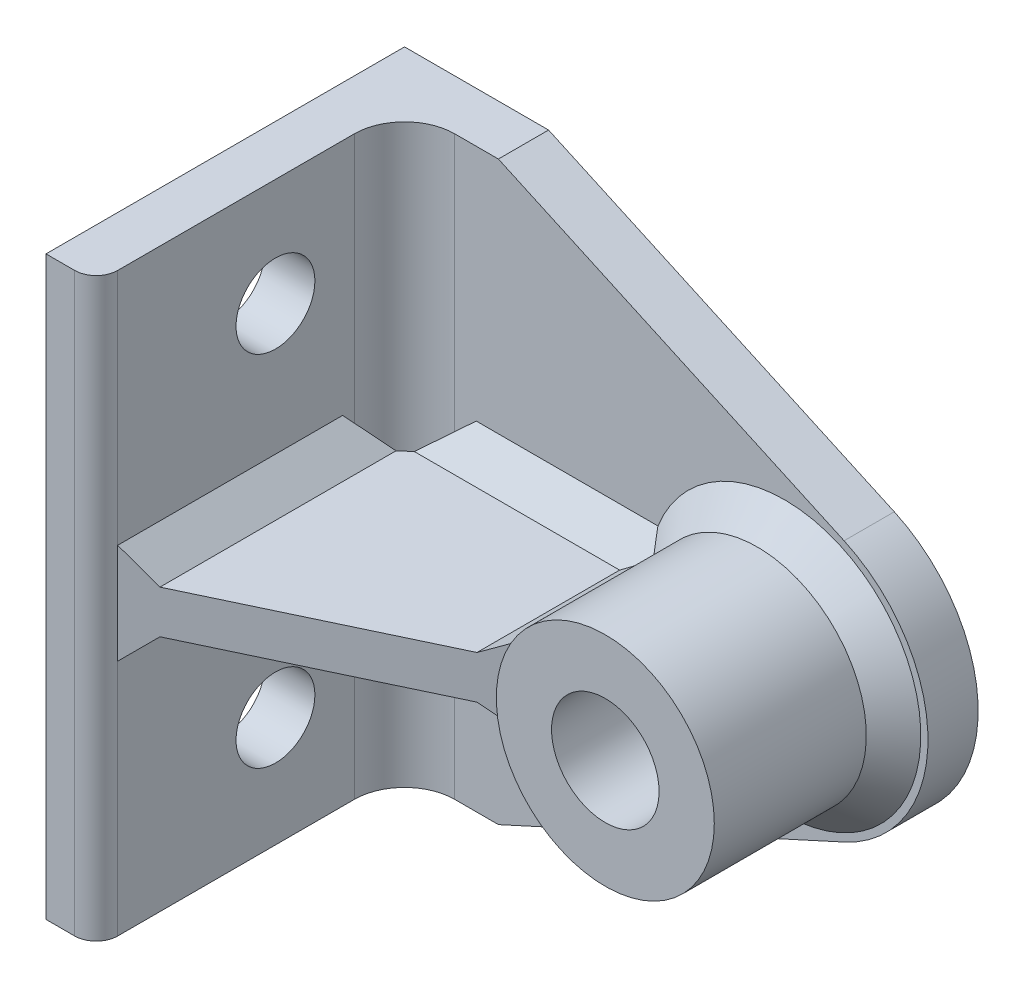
ISO-10303-21;
HEADER;
FILE_DESCRIPTION(('STEP AP214'),'2;1');
FILE_NAME('part.step','',(''),(''),'','','');
FILE_SCHEMA(('AUTOMOTIVE_DESIGN { 1 0 10303 214 1 1 1 1 }'));
ENDSEC;
DATA;
#1=APPLICATION_CONTEXT('core data for automotive mechanical design processes');
#2=APPLICATION_PROTOCOL_DEFINITION('international standard','automotive_design',2000,#1);
#3=PRODUCT_CONTEXT('',#1,'mechanical');
#4=PRODUCT('Part','Part','',(#3));
#5=PRODUCT_RELATED_PRODUCT_CATEGORY('part','',(#4));
#6=PRODUCT_DEFINITION_FORMATION('','',#4);
#7=PRODUCT_DEFINITION_CONTEXT('part definition',#1,'design');
#8=PRODUCT_DEFINITION('design','',#6,#7);
#9=PRODUCT_DEFINITION_SHAPE('','',#8);
#10=(LENGTH_UNIT() NAMED_UNIT(*) SI_UNIT(.MILLI.,.METRE.));
#11=(NAMED_UNIT(*) PLANE_ANGLE_UNIT() SI_UNIT($,.RADIAN.));
#12=(NAMED_UNIT(*) SI_UNIT($,.STERADIAN.) SOLID_ANGLE_UNIT());
#13=UNCERTAINTY_MEASURE_WITH_UNIT(LENGTH_MEASURE(1.E-05),#10,'distance_accuracy_value','');
#14=(GEOMETRIC_REPRESENTATION_CONTEXT(3) GLOBAL_UNCERTAINTY_ASSIGNED_CONTEXT((#13)) GLOBAL_UNIT_ASSIGNED_CONTEXT((#10,
#11,#12)) REPRESENTATION_CONTEXT('',''));
#15=CARTESIAN_POINT('',(0.,0.,0.));
#16=DIRECTION('',(0.,0.,1.));
#17=DIRECTION('',(1.,0.,0.));
#18=AXIS2_PLACEMENT_3D('',#15,#16,#17);
#19=CARTESIAN_POINT('',(60.,0.,32.));
#20=DIRECTION('',(0.,0.,-1.));
#21=DIRECTION('',(-1.,0.,0.));
#22=AXIS2_PLACEMENT_3D('',#19,#20,#21);
#23=CYLINDRICAL_SURFACE('',#22,15.2);
#24=CARTESIAN_POINT('',(60.,0.,32.));
#25=DIRECTION('',(0.,0.,1.));
#26=DIRECTION('',(1.,0.,0.));
#27=AXIS2_PLACEMENT_3D('',#24,#25,#26);
#28=CIRCLE('',#27,15.2);
#29=CARTESIAN_POINT('',(75.2,0.,32.));
#30=VERTEX_POINT('',#29);
#31=EDGE_CURVE('E377',#30,#30,#28,.T.);
#32=ORIENTED_EDGE('',*,*,#31,.F.);
#33=EDGE_LOOP('',(#32));
#34=FACE_BOUND('',#33,.T.);
#35=CARTESIAN_POINT('',(60.,0.,10.8));
#36=DIRECTION('',(0.,0.,-1.));
#37=DIRECTION('',(-1.,0.,0.));
#38=AXIS2_PLACEMENT_3D('',#35,#36,#37);
#39=CIRCLE('',#38,15.2);
#40=CARTESIAN_POINT('',(45.,2.45764114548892,10.8));
#41=VERTEX_POINT('',#40);
#42=CARTESIAN_POINT('',(45.0989933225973,3.00000000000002,10.8));
#43=VERTEX_POINT('',#42);
#44=EDGE_CURVE('E514',#41,#43,#39,.T.);
#45=ORIENTED_EDGE('',*,*,#44,.F.);
#46=DIRECTION('',(0.,0.,-1.));
#47=VECTOR('',#46,1.);
#48=CARTESIAN_POINT('',(45.,2.45764114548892,32.));
#49=LINE('',#48,#47);
#50=CARTESIAN_POINT('',(45.,2.45764114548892,29.));
#51=VERTEX_POINT('',#50);
#52=EDGE_CURVE('E480',#41,#51,#49,.F.);
#53=ORIENTED_EDGE('',*,*,#52,.T.);
#54=CARTESIAN_POINT('',(60.,0.,21.8947368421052));
#55=DIRECTION('',(-0.428086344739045,0.,-0.903737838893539));
#56=DIRECTION('',(0.903737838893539,0.,-0.428086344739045));
#57=AXIS2_PLACEMENT_3D('',#54,#55,#56);
#58=ELLIPSE('',#57,16.8190368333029,15.2);
#59=CARTESIAN_POINT('',(45.,-2.45764114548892,29.));
#60=VERTEX_POINT('',#59);
#61=EDGE_CURVE('E380',#51,#60,#58,.F.);
#62=ORIENTED_EDGE('',*,*,#61,.T.);
#63=DIRECTION('',(0.,0.,-1.));
#64=VECTOR('',#63,1.);
#65=CARTESIAN_POINT('',(45.,-2.45764114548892,32.));
#66=LINE('',#65,#64);
#67=CARTESIAN_POINT('',(45.,-2.45764114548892,10.8));
#68=VERTEX_POINT('',#67);
#69=EDGE_CURVE('E477',#60,#68,#66,.T.);
#70=ORIENTED_EDGE('',*,*,#69,.T.);
#71=CARTESIAN_POINT('',(45.0989933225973,-3.,10.8));
#72=VERTEX_POINT('',#71);
#73=EDGE_CURVE('E732',#72,#68,#39,.T.);
#74=ORIENTED_EDGE('',*,*,#73,.F.);
#75=DIRECTION('',(0.,0.,-1.));
#76=VECTOR('',#75,1.);
#77=CARTESIAN_POINT('',(45.0989933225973,-3.00000000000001,32.));
#78=LINE('',#77,#76);
#79=CARTESIAN_POINT('',(45.0989933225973,-3.,10.9999999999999));
#80=VERTEX_POINT('',#79);
#81=EDGE_CURVE('E508',#72,#80,#78,.F.);
#82=ORIENTED_EDGE('',*,*,#81,.T.);
#83=CARTESIAN_POINT('',(60.,0.,13.9999999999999));
#84=DIRECTION('',(0.,0.707106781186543,-0.707106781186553));
#85=DIRECTION('',(0.,-0.707106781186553,-0.707106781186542));
#86=AXIS2_PLACEMENT_3D('',#83,#84,#85);
#87=ELLIPSE('',#86,21.4960461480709,15.2);
#88=CARTESIAN_POINT('',(45.1406595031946,-3.19999999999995,10.8));
#89=VERTEX_POINT('',#88);
#90=EDGE_CURVE('E512',#80,#89,#87,.F.);
#91=ORIENTED_EDGE('',*,*,#90,.T.);
#92=CARTESIAN_POINT('',(45.3108184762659,-3.90742193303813,10.8));
#93=VERTEX_POINT('',#92);
#94=EDGE_CURVE('E59',#93,#89,#39,.T.);
#95=ORIENTED_EDGE('',*,*,#94,.F.);
#96=DIRECTION('',(0.,0.,-1.));
#97=VECTOR('',#96,1.);
#98=CARTESIAN_POINT('',(45.3108184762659,-3.90742193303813,32.));
#99=LINE('',#98,#97);
#100=CARTESIAN_POINT('',(45.3108184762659,-3.90742193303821,28.852770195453));
#101=VERTEX_POINT('',#100);
#102=EDGE_CURVE('E326',#101,#93,#99,.T.);
#103=ORIENTED_EDGE('',*,*,#102,.F.);
#104=CARTESIAN_POINT('',(60.,0.,21.8947368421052));
#105=DIRECTION('',(-0.428086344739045,0.,-0.903737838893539));
#106=DIRECTION('',(0.903737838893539,0.,-0.428086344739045));
#107=AXIS2_PLACEMENT_3D('',#104,#105,#106);
#108=ELLIPSE('',#107,16.8190368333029,15.2);
#109=CARTESIAN_POINT('',(46.,-5.91945943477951,28.5263157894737));
#110=VERTEX_POINT('',#109);
#111=EDGE_CURVE('E318',#110,#101,#108,.T.);
#112=ORIENTED_EDGE('',*,*,#111,.F.);
#113=DIRECTION('',(0.,0.,-1.));
#114=VECTOR('',#113,1.);
#115=CARTESIAN_POINT('',(46.,-5.91945943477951,52.0107573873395));
#116=LINE('',#115,#114);
#117=CARTESIAN_POINT('',(46.,-5.91945943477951,10.8));
#118=VERTEX_POINT('',#117);
#119=EDGE_CURVE('E314',#110,#118,#116,.T.);
#120=ORIENTED_EDGE('',*,*,#119,.T.);
#121=CARTESIAN_POINT('',(45.8529822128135,5.55894663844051,10.8));
#122=VERTEX_POINT('',#121);
#123=EDGE_CURVE('E738',#122,#118,#39,.T.);
#124=ORIENTED_EDGE('',*,*,#123,.F.);
#125=DIRECTION('',(0.,0.,-1.));
#126=VECTOR('',#125,1.);
#127=CARTESIAN_POINT('',(45.8529822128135,5.55894663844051,32.));
#128=LINE('',#127,#126);
#129=CARTESIAN_POINT('',(45.8529822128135,5.55894663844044,28.5959557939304));
#130=VERTEX_POINT('',#129);
#131=EDGE_CURVE('E487',#130,#122,#128,.T.);
#132=ORIENTED_EDGE('',*,*,#131,.F.);
#133=CARTESIAN_POINT('',(60.,0.,21.8947368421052));
#134=DIRECTION('',(-0.428086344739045,0.,-0.903737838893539));
#135=DIRECTION('',(0.903737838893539,0.,-0.428086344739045));
#136=AXIS2_PLACEMENT_3D('',#133,#134,#135);
#137=ELLIPSE('',#136,16.8190368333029,15.2);
#138=CARTESIAN_POINT('',(45.3470177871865,4.04105336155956,28.835623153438));
#139=VERTEX_POINT('',#138);
#140=EDGE_CURVE('E482',#139,#130,#137,.T.);
#141=ORIENTED_EDGE('',*,*,#140,.F.);
#142=DIRECTION('',(0.,0.,-1.));
#143=VECTOR('',#142,1.);
#144=CARTESIAN_POINT('',(45.3470177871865,4.0410533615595,32.));
#145=LINE('',#144,#143);
#146=CARTESIAN_POINT('',(45.3470177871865,4.0410533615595,10.8));
#147=VERTEX_POINT('',#146);
#148=EDGE_CURVE('E485',#147,#139,#145,.F.);
#149=ORIENTED_EDGE('',*,*,#148,.F.);
#150=CARTESIAN_POINT('',(45.1406595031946,3.2,10.8));
#151=VERTEX_POINT('',#150);
#152=EDGE_CURVE('E613',#151,#147,#39,.T.);
#153=ORIENTED_EDGE('',*,*,#152,.F.);
#154=CARTESIAN_POINT('',(60.,0.,14.));
#155=DIRECTION('',(0.,-0.707106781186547,-0.707106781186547));
#156=DIRECTION('',(0.,0.707106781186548,-0.707106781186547));
#157=AXIS2_PLACEMENT_3D('',#154,#155,#156);
#158=ELLIPSE('',#157,21.496046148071,15.2);
#159=CARTESIAN_POINT('',(45.0989933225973,3.,11.));
#160=VERTEX_POINT('',#159);
#161=EDGE_CURVE('E310',#151,#160,#158,.F.);
#162=ORIENTED_EDGE('',*,*,#161,.T.);
#163=DIRECTION('',(0.,0.,-1.));
#164=VECTOR('',#163,1.);
#165=CARTESIAN_POINT('',(45.0989933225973,3.00000000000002,32.));
#166=LINE('',#165,#164);
#167=EDGE_CURVE('E308',#160,#43,#166,.T.);
#168=ORIENTED_EDGE('',*,*,#167,.T.);
#169=EDGE_LOOP('',(#45,#53,#62,#70,#74,#82,#91,#95,#103,#112,#120,#124,#132,#141,#149,#153,#162,#168));
#170=FACE_BOUND('',#169,.T.);
#171=ADVANCED_FACE('F39',(#34,#170),#23,.T.);
#172=CARTESIAN_POINT('',(45.,-3.,52.0107573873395));
#173=DIRECTION('',(-0.946041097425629,-0.324046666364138,0.));
#174=DIRECTION('',(0.324046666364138,-0.946041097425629,0.));
#175=AXIS2_PLACEMENT_3D('',#172,#173,#174);
#176=PLANE('',#175);
#177=CARTESIAN_POINT('',(44.9999314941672,-2.9998,10.7029135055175));
#178=CARTESIAN_POINT('',(45.0515956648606,-3.15063145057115,10.7240285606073));
#179=CARTESIAN_POINT('',(45.1033406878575,-3.30169894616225,10.7426778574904));
#180=CARTESIAN_POINT('',(45.2069925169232,-3.60430625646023,10.7750449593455));
#181=CARTESIAN_POINT('',(45.2588993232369,-3.75584607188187,10.7887627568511));
#182=CARTESIAN_POINT('',(45.3108869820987,-3.90762193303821,10.8000147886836));
#183=B_SPLINE_CURVE_WITH_KNOTS('',3,(#177,#178,#179,#180,#181,#182),.UNSPECIFIED.,.F.,.F.,(4,2,
4),(0.,0.482307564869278,0.964615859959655),.UNSPECIFIED.);
#184=CARTESIAN_POINT('',(45.0900206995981,-3.26281178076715,10.7371882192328));
#185=VERTEX_POINT('',#184);
#186=EDGE_CURVE('E580',#185,#93,#183,.T.);
#187=ORIENTED_EDGE('',*,*,#186,.F.);
#188=DIRECTION('',(0.235398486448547,-0.687236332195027,-0.687236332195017));
#189=VECTOR('',#188,1.);
#190=CARTESIAN_POINT('',(38.3655096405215,16.3691254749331,30.3691254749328));
#191=LINE('',#190,#189);
#192=CARTESIAN_POINT('',(45.,-3.,10.9999999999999));
#193=VERTEX_POINT('',#192);
#194=EDGE_CURVE('E311',#193,#185,#191,.T.);
#195=ORIENTED_EDGE('',*,*,#194,.F.);
#196=DIRECTION('',(0.,0.,-1.));
#197=VECTOR('',#196,1.);
#198=CARTESIAN_POINT('',(45.,-3.,29.));
#199=LINE('',#198,#197);
#200=CARTESIAN_POINT('',(45.,-3.,29.));
#201=VERTEX_POINT('',#200);
#202=EDGE_CURVE('E386',#201,#193,#199,.T.);
#203=ORIENTED_EDGE('',*,*,#202,.F.);
#204=DIRECTION('',(0.320295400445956,-0.935089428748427,-0.151718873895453));
#205=VECTOR('',#204,1.);
#206=CARTESIAN_POINT('',(43.8817955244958,0.264552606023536,29.5296758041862));
#207=LINE('',#206,#205);
#208=EDGE_CURVE('E315',#201,#101,#207,.T.);
#209=ORIENTED_EDGE('',*,*,#208,.T.);
#210=ORIENTED_EDGE('',*,*,#102,.T.);
#211=EDGE_LOOP('',(#187,#195,#203,#209,#210));
#212=FACE_BOUND('',#211,.T.);
#213=ADVANCED_FACE('F634',(#212),#176,.F.);
#214=CARTESIAN_POINT('',(46.,-5.91945943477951,52.0107573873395));
#215=DIRECTION('',(0.504230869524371,0.8635688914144,0.));
#216=DIRECTION('',(-0.863568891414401,0.504230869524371,0.));
#217=AXIS2_PLACEMENT_3D('',#214,#215,#216);
#218=PLANE('',#217);
#219=CARTESIAN_POINT('',(46.0002,-5.9195762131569,10.8001387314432));
#220=CARTESIAN_POINT('',(45.8495733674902,-5.83162654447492,10.6956513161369));
#221=CARTESIAN_POINT('',(45.699680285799,-5.74410519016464,10.589758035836));
#222=CARTESIAN_POINT('',(45.4012744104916,-5.56986842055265,10.375409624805));
#223=CARTESIAN_POINT('',(45.2527615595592,-5.48315297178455,10.2669546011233));
#224=CARTESIAN_POINT('',(44.8093049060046,-5.22422222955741,9.93822742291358));
#225=CARTESIAN_POINT('',(44.5162797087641,-5.05312719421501,9.71447921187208));
#226=CARTESIAN_POINT('',(43.9347468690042,-4.71357488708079,9.25937669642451));
#227=CARTESIAN_POINT('',(43.646238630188,-4.54511726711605,9.02802340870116));
#228=CARTESIAN_POINT('',(43.0729865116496,-4.21040000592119,8.55876606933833));
#229=CARTESIAN_POINT('',(42.7882447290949,-4.04414158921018,8.32085857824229));
#230=CARTESIAN_POINT('',(42.5051834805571,-3.87886442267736,8.08034056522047));
#231=B_SPLINE_CURVE_WITH_KNOTS('',3,(#219,#220,#221,#222,#223,#224,#225,#226,#227,#228,#229,
#230),.UNSPECIFIED.,.F.,.F.,(4,2,2,2,2,4),(0.,0.609958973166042,1.21989250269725,
2.43909748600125,3.65814013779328,4.87783517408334),.UNSPECIFIED.);
#232=CARTESIAN_POINT('',(43.9557030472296,-4.7258110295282,9.27418897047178));
#233=VERTEX_POINT('',#232);
#234=EDGE_CURVE('E67',#118,#233,#231,.T.);
#235=ORIENTED_EDGE('',*,*,#234,.F.);
#236=ORIENTED_EDGE('',*,*,#119,.F.);
#237=DIRECTION('',(-0.799282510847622,0.46669457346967,0.378607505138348));
#238=VECTOR('',#237,1.);
#239=CARTESIAN_POINT('',(38.8932707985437,-1.7698979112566,31.8926612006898));
#240=LINE('',#239,#238);
#241=CARTESIAN_POINT('',(41.,-3.,30.8947368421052));
#242=VERTEX_POINT('',#241);
#243=EDGE_CURVE('E319',#110,#242,#240,.T.);
#244=ORIENTED_EDGE('',*,*,#243,.T.);
#245=DIRECTION('',(0.,0.,-1.));
#246=VECTOR('',#245,1.);
#247=CARTESIAN_POINT('',(41.,-3.,52.0107573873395));
#248=LINE('',#247,#246);
#249=CARTESIAN_POINT('',(41.,-3.,10.9999999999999));
#250=VERTEX_POINT('',#249);
#251=EDGE_CURVE('E321',#242,#250,#248,.T.);
#252=ORIENTED_EDGE('',*,*,#251,.T.);
#253=DIRECTION('',(-0.771090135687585,0.450233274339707,0.450233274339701));
#254=VECTOR('',#253,1.);
#255=CARTESIAN_POINT('',(30.7487274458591,2.98563487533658,16.9856348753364));
#256=LINE('',#255,#254);
#257=EDGE_CURVE('E52',#233,#250,#256,.T.);
#258=ORIENTED_EDGE('',*,*,#257,.F.);
#259=EDGE_LOOP('',(#235,#236,#244,#252,#258));
#260=FACE_BOUND('',#259,.T.);
#261=ADVANCED_FACE('F499',(#260),#218,.F.);
#262=CARTESIAN_POINT('',(45.,3.,52.0107573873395));
#263=DIRECTION('',(-0.948683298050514,0.316227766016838,0.));
#264=DIRECTION('',(-0.316227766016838,-0.948683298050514,0.));
#265=AXIS2_PLACEMENT_3D('',#262,#263,#264);
#266=PLANE('',#265);
#267=CARTESIAN_POINT('',(46.0000666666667,6.0002,10.7684362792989));
#268=CARTESIAN_POINT('',(45.9755666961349,5.92670008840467,10.7748738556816));
#269=CARTESIAN_POINT('',(45.9510541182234,5.85316235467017,10.7807238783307));
#270=CARTESIAN_POINT('',(45.9020037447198,5.70601123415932,10.7912488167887));
#271=CARTESIAN_POINT('',(45.8774659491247,5.63239784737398,10.7959237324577));
#272=CARTESIAN_POINT('',(45.8529155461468,5.55874663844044,10.8000110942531));
#273=B_SPLINE_CURVE_WITH_KNOTS('',3,(#267,#268,#269,#270,#271,#272),.UNSPECIFIED.,.F.,.F.,(4,2,
4),(0.,0.233208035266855,0.466416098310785),.UNSPECIFIED.);
#274=CARTESIAN_POINT('',(46.,6.,10.7684537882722));
#275=VERTEX_POINT('',#274);
#276=EDGE_CURVE('E533',#275,#122,#273,.T.);
#277=ORIENTED_EDGE('',*,*,#276,.F.);
#278=DIRECTION('',(0.,0.,-1.));
#279=VECTOR('',#278,1.);
#280=CARTESIAN_POINT('',(46.,6.,52.0107573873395));
#281=LINE('',#280,#279);
#282=CARTESIAN_POINT('',(46.,6.,28.5263157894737));
#283=VERTEX_POINT('',#282);
#284=EDGE_CURVE('E333',#283,#275,#281,.T.);
#285=ORIENTED_EDGE('',*,*,#284,.F.);
#286=DIRECTION('',(-0.312738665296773,-0.938215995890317,0.148139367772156));
#287=VECTOR('',#286,1.);
#288=CARTESIAN_POINT('',(43.9339367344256,-0.198189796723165,29.5049773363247));
#289=LINE('',#288,#287);
#290=EDGE_CURVE('E334',#283,#130,#289,.T.);
#291=ORIENTED_EDGE('',*,*,#290,.T.);
#292=ORIENTED_EDGE('',*,*,#131,.T.);
#293=EDGE_LOOP('',(#277,#285,#291,#292));
#294=FACE_BOUND('',#293,.T.);
#295=ADVANCED_FACE('F832',(#294),#266,.F.);
#296=CARTESIAN_POINT('',(45.3470844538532,4.04125336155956,10.8000110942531));
#297=CARTESIAN_POINT('',(45.2890444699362,3.86713340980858,10.7903143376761));
#298=CARTESIAN_POINT('',(45.2310951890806,3.69328556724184,10.7773746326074));
#299=CARTESIAN_POINT('',(45.1153781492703,3.346134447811,10.7450093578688));
#300=CARTESIAN_POINT('',(45.0576103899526,3.17283116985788,10.7255838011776));
#301=CARTESIAN_POINT('',(44.9999333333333,2.9998,10.7029153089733));
#302=B_SPLINE_CURVE_WITH_KNOTS('',3,(#296,#297,#298,#299,#300,#301),.UNSPECIFIED.,.F.,.F.,(4,2,
4),(0.,0.551123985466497,1.10224686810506),.UNSPECIFIED.);
#303=CARTESIAN_POINT('',(45.0883117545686,3.26493526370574,10.7350647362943));
#304=VERTEX_POINT('',#303);
#305=EDGE_CURVE('E531',#147,#304,#302,.T.);
#306=ORIENTED_EDGE('',*,*,#305,.F.);
#307=ORIENTED_EDGE('',*,*,#148,.T.);
#308=CARTESIAN_POINT('',(45.,3.,29.));
#309=VERTEX_POINT('',#308);
#310=EDGE_CURVE('E332',#139,#309,#289,.T.);
#311=ORIENTED_EDGE('',*,*,#310,.T.);
#312=DIRECTION('',(0.,0.,-1.));
#313=VECTOR('',#312,1.);
#314=CARTESIAN_POINT('',(45.,3.,29.));
#315=LINE('',#314,#313);
#316=CARTESIAN_POINT('',(45.,3.,11.));
#317=VERTEX_POINT('',#316);
#318=EDGE_CURVE('E394',#309,#317,#315,.T.);
#319=ORIENTED_EDGE('',*,*,#318,.T.);
#320=DIRECTION('',(-0.229415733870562,-0.688247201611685,0.688247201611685));
#321=VECTOR('',#320,1.);
#322=CARTESIAN_POINT('',(38.5246172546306,-16.4261482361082,30.4261482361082));
#323=LINE('',#322,#321);
#324=EDGE_CURVE('E298',#304,#317,#323,.T.);
#325=ORIENTED_EDGE('',*,*,#324,.F.);
#326=EDGE_LOOP('',(#306,#307,#311,#319,#325));
#327=FACE_BOUND('',#326,.T.);
#328=ADVANCED_FACE('F748',(#327),#266,.F.);
#329=CARTESIAN_POINT('',(46.,6.,52.0107573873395));
#330=DIRECTION('',(0.514495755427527,-0.857492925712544,0.));
#331=DIRECTION('',(0.857492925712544,0.514495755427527,0.));
#332=AXIS2_PLACEMENT_3D('',#329,#330,#331);
#333=PLANE('',#332);
#334=CARTESIAN_POINT('',(42.416303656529,3.84978219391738,7.9998));
#335=CARTESIAN_POINT('',(42.7061802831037,4.0237081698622,8.24570676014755));
#336=CARTESIAN_POINT('',(42.9978540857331,4.19871245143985,8.48878159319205));
#337=CARTESIAN_POINT('',(43.5852292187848,4.55113753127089,8.96776465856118));
#338=CARTESIAN_POINT('',(43.8809280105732,4.72855680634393,9.20367713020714));
#339=CARTESIAN_POINT('',(44.47718056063,5.08630833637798,9.6671684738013));
#340=CARTESIAN_POINT('',(44.777735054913,5.26664103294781,9.89474606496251));
#341=CARTESIAN_POINT('',(45.2327859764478,5.53967158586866,10.2285175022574));
#342=CARTESIAN_POINT('',(45.3852201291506,5.63113207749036,10.3385413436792));
#343=CARTESIAN_POINT('',(45.6915731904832,5.81494391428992,10.5557591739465));
#344=CARTESIAN_POINT('',(45.8454921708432,5.9072953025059,10.6629530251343));
#345=CARTESIAN_POINT('',(46.0002,6.00012,10.7685903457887));
#346=B_SPLINE_CURVE_WITH_KNOTS('',3,(#334,#335,#336,#337,#338,#339,#340,#341,#342,#343,#344,
#345),.UNSPECIFIED.,.F.,.F.,(4,2,2,2,2,4),(0.,1.25411570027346,2.50747402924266,
3.76102415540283,4.38818335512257,5.01537300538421),.UNSPECIFIED.);
#347=CARTESIAN_POINT('',(43.9311366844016,4.75868201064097,9.24131798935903));
#348=VERTEX_POINT('',#347);
#349=EDGE_CURVE('E527',#348,#275,#346,.T.);
#350=ORIENTED_EDGE('',*,*,#349,.F.);
#351=DIRECTION('',(0.762492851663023,0.457495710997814,-0.457495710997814));
#352=VECTOR('',#351,1.);
#353=CARTESIAN_POINT('',(30.6474102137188,-3.21155387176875,17.2115538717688));
#354=LINE('',#353,#352);
#355=CARTESIAN_POINT('',(41.,3.,11.));
#356=VERTEX_POINT('',#355);
#357=EDGE_CURVE('E490',#356,#348,#354,.T.);
#358=ORIENTED_EDGE('',*,*,#357,.F.);
#359=DIRECTION('',(0.,0.,-1.));
#360=VECTOR('',#359,1.);
#361=CARTESIAN_POINT('',(41.,3.,52.0107573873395));
#362=LINE('',#361,#360);
#363=CARTESIAN_POINT('',(41.,3.,30.8947368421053));
#364=VERTEX_POINT('',#363);
#365=EDGE_CURVE('E328',#364,#356,#362,.T.);
#366=ORIENTED_EDGE('',*,*,#365,.F.);
#367=DIRECTION('',(0.794457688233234,0.476674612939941,-0.376322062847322));
#368=VECTOR('',#367,1.);
#369=CARTESIAN_POINT('',(38.9788105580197,1.78728633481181,31.8521423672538));
#370=LINE('',#369,#368);
#371=EDGE_CURVE('E329',#364,#283,#370,.T.);
#372=ORIENTED_EDGE('',*,*,#371,.T.);
#373=ORIENTED_EDGE('',*,*,#284,.T.);
#374=EDGE_LOOP('',(#350,#358,#366,#372,#373));
#375=FACE_BOUND('',#374,.T.);
#376=ADVANCED_FACE('F659',(#375),#333,.F.);
#377=CARTESIAN_POINT('',(45.,3.,29.));
#378=DIRECTION('',(-1.,0.,0.));
#379=DIRECTION('',(0.,0.,1.));
#380=AXIS2_PLACEMENT_3D('',#377,#378,#379);
#381=PLANE('',#380);
#382=CARTESIAN_POINT('',(45.,9.79200752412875,8.08678110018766));
#383=CARTESIAN_POINT('',(45.,9.51263089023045,8.23947397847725));
#384=CARTESIAN_POINT('',(45.,9.23132076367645,8.38868848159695));
#385=CARTESIAN_POINT('',(45.,8.66446866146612,8.67910175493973));
#386=CARTESIAN_POINT('',(45.,8.37892517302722,8.82029756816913));
#387=CARTESIAN_POINT('',(45.,7.80209705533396,9.09414127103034));
#388=CARTESIAN_POINT('',(45.,7.51079178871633,9.22674599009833));
#389=CARTESIAN_POINT('',(45.,6.92363780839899,9.48132168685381));
#390=CARTESIAN_POINT('',(45.,6.62778959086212,9.6032938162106));
#391=CARTESIAN_POINT('',(45.,5.75309995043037,9.94334053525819));
#392=CARTESIAN_POINT('',(45.,5.16760775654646,10.1449769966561));
#393=CARTESIAN_POINT('',(45.,4.27756542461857,10.4045782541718));
#394=CARTESIAN_POINT('',(45.,3.9791589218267,10.4839237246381));
#395=CARTESIAN_POINT('',(45.,3.37863227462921,10.6269666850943));
#396=CARTESIAN_POINT('',(45.,3.07651274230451,10.6906667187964));
#397=CARTESIAN_POINT('',(45.,2.40499397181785,10.8127274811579));
#398=CARTESIAN_POINT('',(45.,2.03486313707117,10.8671182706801));
#399=CARTESIAN_POINT('',(45.,1.29152206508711,10.9490311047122));
#400=CARTESIAN_POINT('',(45.,0.918311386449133,10.9765492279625));
#401=CARTESIAN_POINT('',(45.,0.354060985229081,10.9970345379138));
#402=CARTESIAN_POINT('',(45.,0.163346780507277,11.0003238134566));
#403=CARTESIAN_POINT('',(45.,-0.218080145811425,10.9996262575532));
#404=CARTESIAN_POINT('',(45.,-0.408792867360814,10.9956393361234));
#405=CARTESIAN_POINT('',(45.,-0.789986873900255,10.9804190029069));
#406=CARTESIAN_POINT('',(45.,-0.980468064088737,10.9691832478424));
#407=CARTESIAN_POINT('',(45.,-1.3608730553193,10.9395908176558));
#408=CARTESIAN_POINT('',(45.,-1.55079686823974,10.9212342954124));
#409=CARTESIAN_POINT('',(45.,-1.740314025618,10.89938104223));
#410=B_SPLINE_CURVE_WITH_KNOTS('',3,(#382,#383,#384,#385,#386,#387,#388,#389,#390,#391,#392,
#393,#394,#395,#396,#397,#398,#399,#400,#401,#402,#403,#404,#405,#406,#407,#408,#409),
.UNSPECIFIED.,.F.,.F.,(4,2,2,2,2,2,2,2,2,2,2,2,2,4),(0.,0.955157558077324,1.91066508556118,
2.8706515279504,3.8305338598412,5.68544834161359,6.61143622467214,7.53727345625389,
8.6586736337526,9.78023742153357,10.3523485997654,10.9244668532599,11.4967701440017,
12.0690611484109),.UNSPECIFIED.);
#411=CARTESIAN_POINT('',(45.,3.,10.7029414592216));
#412=VERTEX_POINT('',#411);
#413=EDGE_CURVE('E612',#412,#41,#410,.T.);
#414=ORIENTED_EDGE('',*,*,#413,.F.);
#415=DIRECTION('',(0.,0.,-1.));
#416=VECTOR('',#415,1.);
#417=CARTESIAN_POINT('',(45.,3.00000000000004,52.0107573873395));
#418=LINE('',#417,#416);
#419=EDGE_CURVE('E301',#317,#412,#418,.T.);
#420=ORIENTED_EDGE('',*,*,#419,.F.);
#421=ORIENTED_EDGE('',*,*,#318,.F.);
#422=DIRECTION('',(0.,-1.,0.));
#423=VECTOR('',#422,1.);
#424=CARTESIAN_POINT('',(45.,3.,29.));
#425=LINE('',#424,#423);
#426=EDGE_CURVE('E399',#309,#51,#425,.T.);
#427=ORIENTED_EDGE('',*,*,#426,.T.);
#428=ORIENTED_EDGE('',*,*,#52,.F.);
#429=EDGE_LOOP('',(#414,#420,#421,#427,#428));
#430=FACE_BOUND('',#429,.T.);
#431=ADVANCED_FACE('F654',(#430),#381,.F.);
#432=CARTESIAN_POINT('',(45.,1.740314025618,10.89938104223));
#433=CARTESIAN_POINT('',(45.,1.55079686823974,10.9212342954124));
#434=CARTESIAN_POINT('',(45.,1.3608730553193,10.9395908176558));
#435=CARTESIAN_POINT('',(45.,0.980468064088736,10.9691832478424));
#436=CARTESIAN_POINT('',(45.,0.789986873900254,10.9804190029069));
#437=CARTESIAN_POINT('',(45.,0.408792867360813,10.9956393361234));
#438=CARTESIAN_POINT('',(45.,0.218080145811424,10.9996262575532));
#439=CARTESIAN_POINT('',(45.,-0.163346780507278,11.0003238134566));
#440=CARTESIAN_POINT('',(45.,-0.354060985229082,10.9970345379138));
#441=CARTESIAN_POINT('',(45.,-0.918311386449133,10.9765492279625));
#442=CARTESIAN_POINT('',(45.,-1.29152206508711,10.9490311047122));
#443=CARTESIAN_POINT('',(45.,-2.03486313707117,10.8671182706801));
#444=CARTESIAN_POINT('',(45.,-2.40499397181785,10.8127274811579));
#445=CARTESIAN_POINT('',(45.,-3.07651274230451,10.6906667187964));
#446=CARTESIAN_POINT('',(45.,-3.37863227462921,10.6269666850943));
#447=CARTESIAN_POINT('',(45.,-3.97915892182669,10.4839237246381));
#448=CARTESIAN_POINT('',(45.,-4.27756542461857,10.4045782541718));
#449=CARTESIAN_POINT('',(45.,-5.16760775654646,10.1449769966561));
#450=CARTESIAN_POINT('',(45.,-5.75309995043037,9.94334053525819));
#451=CARTESIAN_POINT('',(45.,-6.62778959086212,9.6032938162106));
#452=CARTESIAN_POINT('',(45.,-6.92363780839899,9.48132168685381));
#453=CARTESIAN_POINT('',(45.,-7.51079178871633,9.22674599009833));
#454=CARTESIAN_POINT('',(45.,-7.80209705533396,9.09414127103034));
#455=CARTESIAN_POINT('',(45.,-8.37892517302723,8.82029756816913));
#456=CARTESIAN_POINT('',(45.,-8.66446866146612,8.67910175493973));
#457=CARTESIAN_POINT('',(45.,-9.23132076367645,8.38868848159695));
#458=CARTESIAN_POINT('',(45.,-9.51263089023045,8.23947397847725));
#459=CARTESIAN_POINT('',(45.,-9.79200752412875,8.08678110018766));
#460=B_SPLINE_CURVE_WITH_KNOTS('',3,(#432,#433,#434,#435,#436,#437,#438,#439,#440,#441,#442,
#443,#444,#445,#446,#447,#448,#449,#450,#451,#452,#453,#454,#455,#456,#457,#458,#459),
.UNSPECIFIED.,.F.,.F.,(4,2,2,2,2,2,2,2,2,2,2,2,2,4),(0.,0.572291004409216,1.14459429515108,
1.71671254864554,2.28882372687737,3.41038751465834,4.53178769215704,5.45762492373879,
6.38361280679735,8.23852728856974,9.19840962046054,10.1583960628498,11.1139035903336,
12.0690611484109),.UNSPECIFIED.);
#461=CARTESIAN_POINT('',(45.,-3.,10.7029414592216));
#462=VERTEX_POINT('',#461);
#463=EDGE_CURVE('E565',#68,#462,#460,.T.);
#464=ORIENTED_EDGE('',*,*,#463,.F.);
#465=ORIENTED_EDGE('',*,*,#69,.F.);
#466=EDGE_CURVE('E280',#60,#201,#425,.T.);
#467=ORIENTED_EDGE('',*,*,#466,.T.);
#468=ORIENTED_EDGE('',*,*,#202,.T.);
#469=DIRECTION('',(0.,0.,1.));
#470=VECTOR('',#469,1.);
#471=CARTESIAN_POINT('',(45.,-3.00000000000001,52.0107573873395));
#472=LINE('',#471,#470);
#473=EDGE_CURVE('E507',#462,#193,#472,.T.);
#474=ORIENTED_EDGE('',*,*,#473,.F.);
#475=EDGE_LOOP('',(#464,#465,#467,#468,#474));
#476=FACE_BOUND('',#475,.T.);
#477=ADVANCED_FACE('F658',(#476),#381,.F.);
#478=CARTESIAN_POINT('',(80.001,7.,7.));
#479=DIRECTION('',(0.,-0.707106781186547,-0.707106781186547));
#480=DIRECTION('',(0.,0.707106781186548,-0.707106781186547));
#481=AXIS2_PLACEMENT_3D('',#478,#479,#480);
#482=PLANE('',#481);
#483=DIRECTION('',(-1.,0.,0.));
#484=VECTOR('',#483,1.);
#485=CARTESIAN_POINT('',(80.001,7.,7.));
#486=LINE('',#485,#484);
#487=CARTESIAN_POINT('',(42.3364782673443,7.,7.));
#488=VERTEX_POINT('',#487);
#489=CARTESIAN_POINT('',(17.,7.00000000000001,7.));
#490=VERTEX_POINT('',#489);
#491=EDGE_CURVE('E275',#488,#490,#486,.T.);
#492=ORIENTED_EDGE('',*,*,#491,.T.);
#493=DIRECTION('',(-0.633647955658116,-0.547033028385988,0.547033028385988));
#494=VECTOR('',#493,1.);
#495=CARTESIAN_POINT('',(42.2955146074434,28.8378073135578,-14.8378073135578));
#496=LINE('',#495,#494);
#497=CARTESIAN_POINT('',(12.3666566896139,3.,11.));
#498=VERTEX_POINT('',#497);
#499=EDGE_CURVE('E284',#490,#498,#496,.T.);
#500=ORIENTED_EDGE('',*,*,#499,.T.);
#501=DIRECTION('',(-1.,0.,0.));
#502=VECTOR('',#501,1.);
#503=CARTESIAN_POINT('',(80.001,3.,11.));
#504=LINE('',#503,#502);
#505=EDGE_CURVE('E304',#356,#498,#504,.T.);
#506=ORIENTED_EDGE('',*,*,#505,.F.);
#507=ORIENTED_EDGE('',*,*,#357,.T.);
#508=CARTESIAN_POINT('',(42.3363423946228,7.0002,6.9998));
#509=CARTESIAN_POINT('',(42.566954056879,6.66078292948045,7.33921707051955));
#510=CARTESIAN_POINT('',(42.8012008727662,6.32258880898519,7.67741119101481));
#511=CARTESIAN_POINT('',(43.277651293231,5.64916682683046,8.35083317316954));
#512=CARTESIAN_POINT('',(43.519852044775,5.31393795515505,8.68606204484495));
#513=CARTESIAN_POINT('',(44.0130847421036,4.64669107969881,9.35330892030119));
#514=CARTESIAN_POINT('',(44.2641175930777,4.31467340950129,9.68532659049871));
#515=CARTESIAN_POINT('',(44.7760482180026,3.65431269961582,10.3456873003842));
#516=CARTESIAN_POINT('',(45.0369494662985,3.32597100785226,10.6740289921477));
#517=CARTESIAN_POINT('',(45.3032248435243,2.9998,11.0002));
#518=B_SPLINE_CURVE_WITH_KNOTS('',3,(#508,#509,#510,#511,#512,#513,#514,#515,#516,#517),
.UNSPECIFIED.,.F.,.F.,(4,2,2,2,4),(0.,1.59760055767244,3.19463419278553,4.79183198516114,
6.38959743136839),.UNSPECIFIED.);
#519=EDGE_CURVE('E297',#488,#348,#518,.T.);
#520=ORIENTED_EDGE('',*,*,#519,.F.);
#521=EDGE_LOOP('',(#492,#500,#506,#507,#520));
#522=FACE_BOUND('',#521,.T.);
#523=ADVANCED_FACE('F294',(#522),#482,.F.);
#524=CARTESIAN_POINT('',(80.001,3.,7.));
#525=DIRECTION('',(0.,1.,0.));
#526=DIRECTION('',(0.,0.,1.));
#527=AXIS2_PLACEMENT_3D('',#524,#525,#526);
#528=PLANE('',#527);
#529=CARTESIAN_POINT('',(50.0931667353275,3.00000000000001,15.6488964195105));
#530=CARTESIAN_POINT('',(49.8762461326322,3.,15.4412799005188));
#531=CARTESIAN_POINT('',(49.6596053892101,3.,15.2333714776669));
#532=CARTESIAN_POINT('',(49.2268037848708,3.,14.817056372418));
#533=CARTESIAN_POINT('',(49.0106429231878,3.,14.6086496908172));
#534=CARTESIAN_POINT('',(48.3627618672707,3.,13.9828119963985));
#535=CARTESIAN_POINT('',(47.931640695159,3.,13.5647609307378));
#536=CARTESIAN_POINT('',(47.0705691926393,3.,12.7274676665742));
#537=CARTESIAN_POINT('',(46.6406188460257,3.,12.3082254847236));
#538=CARTESIAN_POINT('',(45.7815985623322,3.,11.4688389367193));
#539=CARTESIAN_POINT('',(45.3525286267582,3.,11.048694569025));
#540=CARTESIAN_POINT('',(44.0663368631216,3.,9.78724693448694));
#541=CARTESIAN_POINT('',(43.2102213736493,3.,8.94491772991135));
#542=CARTESIAN_POINT('',(41.927305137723,3.,7.6801388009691));
#543=CARTESIAN_POINT('',(41.4998729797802,3.,7.25832875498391));
#544=CARTESIAN_POINT('',(40.6453603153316,3.,6.41435249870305));
#545=CARTESIAN_POINT('',(40.2182798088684,2.99999999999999,5.99218628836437));
#546=CARTESIAN_POINT('',(39.7913405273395,2.99999999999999,5.5698771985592));
#547=B_SPLINE_CURVE_WITH_KNOTS('',3,(#529,#530,#531,#532,#533,#534,#535,#536,#537,#538,#539,
#540,#541,#542,#543,#544,#545,#546),.UNSPECIFIED.,.F.,.F.,(4,2,2,2,2,2,2,2,4),(0.,
0.900794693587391,1.80158794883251,3.60316404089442,5.40471506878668,7.20626917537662,
10.8093283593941,12.6108825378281,14.4124369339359),.UNSPECIFIED.);
#548=EDGE_CURVE('E607',#43,#412,#547,.T.);
#549=ORIENTED_EDGE('',*,*,#548,.F.);
#550=ORIENTED_EDGE('',*,*,#167,.F.);
#551=EDGE_CURVE('E299',#160,#317,#504,.T.);
#552=ORIENTED_EDGE('',*,*,#551,.T.);
#553=ORIENTED_EDGE('',*,*,#419,.T.);
#554=EDGE_LOOP('',(#549,#550,#552,#553));
#555=FACE_BOUND('',#554,.T.);
#556=ADVANCED_FACE('F617',(#555),#528,.F.);
#557=CARTESIAN_POINT('',(44.9998,3.37525000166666,10.6247499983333));
#558=CARTESIAN_POINT('',(45.0499813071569,3.3125176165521,10.6874823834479));
#559=CARTESIAN_POINT('',(45.1003573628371,3.24986392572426,10.7501360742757));
#560=CARTESIAN_POINT('',(45.2014989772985,3.12471392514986,10.8752860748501));
#561=CARTESIAN_POINT('',(45.2522645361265,3.06221761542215,10.9377823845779));
#562=CARTESIAN_POINT('',(45.3032248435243,2.9998,11.0002));
#563=B_SPLINE_CURVE_WITH_KNOTS('',3,(#557,#558,#559,#560,#561,#562),.UNSPECIFIED.,.F.,.F.,(4,2,
4),(0.,0.305775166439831,0.611550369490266),.UNSPECIFIED.);
#564=EDGE_CURVE('E528',#304,#151,#563,.T.);
#565=ORIENTED_EDGE('',*,*,#564,.F.);
#566=ORIENTED_EDGE('',*,*,#324,.T.);
#567=ORIENTED_EDGE('',*,*,#551,.F.);
#568=ORIENTED_EDGE('',*,*,#161,.F.);
#569=EDGE_LOOP('',(#565,#566,#567,#568));
#570=FACE_BOUND('',#569,.T.);
#571=ADVANCED_FACE('F620',(#570),#482,.F.);
#572=CARTESIAN_POINT('',(80.001,-3.,10.9999999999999));
#573=DIRECTION('',(0.,0.707106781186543,-0.707106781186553));
#574=DIRECTION('',(0.,0.707106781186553,0.707106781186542));
#575=AXIS2_PLACEMENT_3D('',#572,#573,#574);
#576=PLANE('',#575);
#577=DIRECTION('',(-1.,0.,0.));
#578=VECTOR('',#577,1.);
#579=CARTESIAN_POINT('',(80.001,-3.,10.9999999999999));
#580=LINE('',#579,#578);
#581=CARTESIAN_POINT('',(12.3666566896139,-3.,11.));
#582=VERTEX_POINT('',#581);
#583=EDGE_CURVE('E495',#250,#582,#580,.T.);
#584=ORIENTED_EDGE('',*,*,#583,.T.);
#585=DIRECTION('',(0.633647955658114,-0.547033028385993,-0.547033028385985));
#586=VECTOR('',#585,1.);
#587=CARTESIAN_POINT('',(39.5225037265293,-26.4438462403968,-12.4438462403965));
#588=LINE('',#587,#586);
#589=CARTESIAN_POINT('',(17.,-7.00000000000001,7.));
#590=VERTEX_POINT('',#589);
#591=EDGE_CURVE('E292',#582,#590,#588,.T.);
#592=ORIENTED_EDGE('',*,*,#591,.T.);
#593=DIRECTION('',(-1.,0.,0.));
#594=VECTOR('',#593,1.);
#595=CARTESIAN_POINT('',(80.001,-7.,7.));
#596=LINE('',#595,#594);
#597=CARTESIAN_POINT('',(42.3364782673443,-7.00000000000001,7.));
#598=VERTEX_POINT('',#597);
#599=EDGE_CURVE('E277',#598,#590,#596,.T.);
#600=ORIENTED_EDGE('',*,*,#599,.F.);
#601=CARTESIAN_POINT('',(45.3032248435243,-2.9998,11.0001999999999));
#602=CARTESIAN_POINT('',(45.0369494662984,-3.32597100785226,10.6740289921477));
#603=CARTESIAN_POINT('',(44.7760482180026,-3.65431269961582,10.3456873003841));
#604=CARTESIAN_POINT('',(44.2641175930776,-4.31467340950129,9.68532659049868));
#605=CARTESIAN_POINT('',(44.0130847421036,-4.64669107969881,9.35330892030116));
#606=CARTESIAN_POINT('',(43.5198520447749,-5.31393795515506,8.68606204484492));
#607=CARTESIAN_POINT('',(43.277651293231,-5.64916682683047,8.35083317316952));
#608=CARTESIAN_POINT('',(42.8012008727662,-6.3225888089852,7.6774111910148));
#609=CARTESIAN_POINT('',(42.566954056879,-6.66078292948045,7.33921707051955));
#610=CARTESIAN_POINT('',(42.3363423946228,-7.0002,6.9998));
#611=B_SPLINE_CURVE_WITH_KNOTS('',3,(#601,#602,#603,#604,#605,#606,#607,#608,#609,#610),
.UNSPECIFIED.,.F.,.F.,(4,2,2,2,4),(0.,1.59776544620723,3.19496323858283,4.79199687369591,
6.38959743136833),.UNSPECIFIED.);
#612=EDGE_CURVE('E497',#233,#598,#611,.T.);
#613=ORIENTED_EDGE('',*,*,#612,.F.);
#614=ORIENTED_EDGE('',*,*,#257,.T.);
#615=EDGE_LOOP('',(#584,#592,#600,#613,#614));
#616=FACE_BOUND('',#615,.T.);
#617=ADVANCED_FACE('F493',(#616),#576,.F.);
#618=CARTESIAN_POINT('',(45.3032248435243,-2.9998,11.0001999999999));
#619=CARTESIAN_POINT('',(45.2522645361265,-3.06221761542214,10.9377823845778));
#620=CARTESIAN_POINT('',(45.2014989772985,-3.12471392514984,10.8752860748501));
#621=CARTESIAN_POINT('',(45.100357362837,-3.24986392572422,10.7501360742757));
#622=CARTESIAN_POINT('',(45.0499813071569,-3.31251761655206,10.6874823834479));
#623=CARTESIAN_POINT('',(44.9998,-3.37525000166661,10.6247499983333));
#624=B_SPLINE_CURVE_WITH_KNOTS('',3,(#618,#619,#620,#621,#622,#623),.UNSPECIFIED.,.F.,.F.,(4,2,
4),(0.,0.305775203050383,0.611550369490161),.UNSPECIFIED.);
#625=EDGE_CURVE('E574',#89,#185,#624,.T.);
#626=ORIENTED_EDGE('',*,*,#625,.F.);
#627=ORIENTED_EDGE('',*,*,#90,.F.);
#628=EDGE_CURVE('E504',#80,#193,#580,.T.);
#629=ORIENTED_EDGE('',*,*,#628,.T.);
#630=ORIENTED_EDGE('',*,*,#194,.T.);
#631=EDGE_LOOP('',(#626,#627,#629,#630));
#632=FACE_BOUND('',#631,.T.);
#633=ADVANCED_FACE('F625',(#632),#576,.F.);
#634=CARTESIAN_POINT('',(80.001,-3.,6.99999999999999));
#635=DIRECTION('',(0.,-1.,0.));
#636=DIRECTION('',(0.,0.,-1.));
#637=AXIS2_PLACEMENT_3D('',#634,#635,#636);
#638=PLANE('',#637);
#639=CARTESIAN_POINT('',(39.7913405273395,-3.,5.56987719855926));
#640=CARTESIAN_POINT('',(40.2182798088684,-3.,5.99218628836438));
#641=CARTESIAN_POINT('',(40.6453603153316,-3.,6.41435249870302));
#642=CARTESIAN_POINT('',(41.4998729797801,-3.,7.25832875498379));
#643=CARTESIAN_POINT('',(41.9273051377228,-3.,7.68013880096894));
#644=CARTESIAN_POINT('',(43.210221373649,-3.,8.94491772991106));
#645=CARTESIAN_POINT('',(44.0663368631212,-3.,9.78724693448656));
#646=CARTESIAN_POINT('',(45.3525286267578,-3.,11.0486945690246));
#647=CARTESIAN_POINT('',(45.7815985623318,-3.,11.4688389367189));
#648=CARTESIAN_POINT('',(46.6406188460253,-3.,12.3082254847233));
#649=CARTESIAN_POINT('',(47.070569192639,-3.,12.7274676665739));
#650=CARTESIAN_POINT('',(47.9316406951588,-3.,13.5647609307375));
#651=CARTESIAN_POINT('',(48.3627618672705,-3.,13.9828119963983));
#652=CARTESIAN_POINT('',(49.0106429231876,-3.,14.6086496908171));
#653=CARTESIAN_POINT('',(49.2268037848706,-3.,14.8170563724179));
#654=CARTESIAN_POINT('',(49.65960538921,-3.,15.2333714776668));
#655=CARTESIAN_POINT('',(49.8762461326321,-3.,15.4412799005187));
#656=CARTESIAN_POINT('',(50.0931667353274,-3.,15.6488964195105));
#657=B_SPLINE_CURVE_WITH_KNOTS('',3,(#639,#640,#641,#642,#643,#644,#645,#646,#647,#648,#649,
#650,#651,#652,#653,#654,#655,#656),.UNSPECIFIED.,.F.,.F.,(4,2,2,2,2,2,2,2,4),(0.,
1.80155439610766,3.60310857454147,7.20616775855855,9.00772186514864,10.809272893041,
12.6108489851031,13.5116422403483,14.4124369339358),.UNSPECIFIED.);
#658=EDGE_CURVE('E13',#462,#72,#657,.T.);
#659=ORIENTED_EDGE('',*,*,#658,.F.);
#660=ORIENTED_EDGE('',*,*,#473,.T.);
#661=ORIENTED_EDGE('',*,*,#628,.F.);
#662=ORIENTED_EDGE('',*,*,#81,.F.);
#663=EDGE_LOOP('',(#659,#660,#661,#662));
#664=FACE_BOUND('',#663,.T.);
#665=ADVANCED_FACE('F622',(#664),#638,.F.);
#666=CARTESIAN_POINT('',(80.,40.1937592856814,7.));
#667=DIRECTION('',(0.,0.,-1.));
#668=DIRECTION('',(-1.,0.,0.));
#669=AXIS2_PLACEMENT_3D('',#666,#667,#668);
#670=PLANE('',#669);
#671=DIRECTION('',(0.,-1.,0.));
#672=VECTOR('',#671,1.);
#673=CARTESIAN_POINT('',(17.,3.,6.99999999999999));
#674=LINE('',#673,#672);
#675=EDGE_CURVE('E269',#490,#590,#674,.T.);
#676=ORIENTED_EDGE('',*,*,#675,.F.);
#677=ORIENTED_EDGE('',*,*,#491,.F.);
#678=CARTESIAN_POINT('',(60.,0.,7.));
#679=DIRECTION('',(0.,0.,-1.));
#680=DIRECTION('',(-1.,0.,0.));
#681=AXIS2_PLACEMENT_3D('',#678,#679,#680);
#682=CIRCLE('',#681,19.);
#683=EDGE_CURVE('E291',#488,#598,#682,.T.);
#684=ORIENTED_EDGE('',*,*,#683,.T.);
#685=ORIENTED_EDGE('',*,*,#599,.T.);
#686=EDGE_LOOP('',(#676,#677,#684,#685));
#687=FACE_BOUND('',#686,.T.);
#688=DIRECTION('',(0.,-1.,0.));
#689=VECTOR('',#688,1.);
#690=CARTESIAN_POINT('',(14.,40.1937592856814,6.99999999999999));
#691=LINE('',#690,#689);
#692=CARTESIAN_POINT('',(14.,40.1937592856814,6.99999999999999));
#693=VERTEX_POINT('',#692);
#694=CARTESIAN_POINT('',(14.,-40.1937592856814,6.99999999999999));
#695=VERTEX_POINT('',#694);
#696=EDGE_CURVE('E418',#693,#695,#691,.T.);
#697=ORIENTED_EDGE('',*,*,#696,.T.);
#698=DIRECTION('',(1.,0.,0.));
#699=VECTOR('',#698,1.);
#700=CARTESIAN_POINT('',(80.,-40.1937592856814,7.));
#701=LINE('',#700,#699);
#702=CARTESIAN_POINT('',(20.0884058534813,-40.1937592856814,6.99999999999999));
#703=VERTEX_POINT('',#702);
#704=EDGE_CURVE('E408',#695,#703,#701,.T.);
#705=ORIENTED_EDGE('',*,*,#704,.T.);
#706=DIRECTION('',(-0.909775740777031,-0.415100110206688,0.));
#707=VECTOR('',#706,1.);
#708=CARTESIAN_POINT('',(20.0884058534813,-40.1937592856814,6.99999999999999));
#709=LINE('',#708,#707);
#710=CARTESIAN_POINT('',(68.3020022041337,-18.1955148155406,7.));
#711=VERTEX_POINT('',#710);
#712=EDGE_CURVE('E420',#711,#703,#709,.T.);
#713=ORIENTED_EDGE('',*,*,#712,.F.);
#714=CARTESIAN_POINT('',(60.,0.,7.));
#715=DIRECTION('',(0.,0.,-1.));
#716=DIRECTION('',(-1.,0.,0.));
#717=AXIS2_PLACEMENT_3D('',#714,#715,#716);
#718=CIRCLE('',#717,20.);
#719=CARTESIAN_POINT('',(68.3020022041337,18.1955148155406,7.));
#720=VERTEX_POINT('',#719);
#721=EDGE_CURVE('E464',#720,#711,#718,.T.);
#722=ORIENTED_EDGE('',*,*,#721,.F.);
#723=DIRECTION('',(0.909775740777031,-0.415100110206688,0.));
#724=VECTOR('',#723,1.);
#725=CARTESIAN_POINT('',(20.0884058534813,40.1937592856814,6.99999999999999));
#726=LINE('',#725,#724);
#727=CARTESIAN_POINT('',(20.0884058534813,40.1937592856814,6.99999999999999));
#728=VERTEX_POINT('',#727);
#729=EDGE_CURVE('E424',#728,#720,#726,.T.);
#730=ORIENTED_EDGE('',*,*,#729,.F.);
#731=DIRECTION('',(1.,0.,0.));
#732=VECTOR('',#731,1.);
#733=CARTESIAN_POINT('',(80.,40.1937592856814,7.));
#734=LINE('',#733,#732);
#735=EDGE_CURVE('E415',#693,#728,#734,.T.);
#736=ORIENTED_EDGE('',*,*,#735,.F.);
#737=EDGE_LOOP('',(#697,#705,#713,#722,#730,#736));
#738=FACE_BOUND('',#737,.T.);
#739=ADVANCED_FACE('F271',(#687,#738),#670,.F.);
#740=CARTESIAN_POINT('',(7.,-3.,6.99999999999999));
#741=DIRECTION('',(0.,1.,0.));
#742=DIRECTION('',(0.,0.,1.));
#743=AXIS2_PLACEMENT_3D('',#740,#741,#742);
#744=PLANE('',#743);
#745=ORIENTED_EDGE('',*,*,#583,.F.);
#746=ORIENTED_EDGE('',*,*,#251,.F.);
#747=DIRECTION('',(0.903737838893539,0.,-0.428086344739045));
#748=VECTOR('',#747,1.);
#749=CARTESIAN_POINT('',(7.,-3.,47.));
#750=LINE('',#749,#748);
#751=CARTESIAN_POINT('',(11.,-3.,45.1052631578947));
#752=VERTEX_POINT('',#751);
#753=EDGE_CURVE('E383',#752,#242,#750,.T.);
#754=ORIENTED_EDGE('',*,*,#753,.F.);
#755=DIRECTION('',(0.,0.,-1.));
#756=VECTOR('',#755,1.);
#757=CARTESIAN_POINT('',(11.,-3.,52.0107573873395));
#758=LINE('',#757,#756);
#759=CARTESIAN_POINT('',(11.,-3.,12.1798449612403));
#760=VERTEX_POINT('',#759);
#761=EDGE_CURVE('E337',#752,#760,#758,.T.);
#762=ORIENTED_EDGE('',*,*,#761,.T.);
#763=DIRECTION('',(-0.756946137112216,0.,0.653477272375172));
#764=VECTOR('',#763,1.);
#765=CARTESIAN_POINT('',(7.,-3.,15.6330749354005));
#766=LINE('',#765,#764);
#767=EDGE_CURVE('E389',#582,#760,#766,.T.);
#768=ORIENTED_EDGE('',*,*,#767,.F.);
#769=EDGE_LOOP('',(#745,#746,#754,#762,#768));
#770=FACE_BOUND('',#769,.T.);
#771=ADVANCED_FACE('F503',(#770),#744,.F.);
#772=CARTESIAN_POINT('',(7.,-7.,52.0107573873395));
#773=DIRECTION('',(-0.707106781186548,0.707106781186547,0.));
#774=DIRECTION('',(-0.707106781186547,-0.707106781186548,0.));
#775=AXIS2_PLACEMENT_3D('',#772,#773,#774);
#776=PLANE('',#775);
#777=DIRECTION('',(0.,0.,-1.));
#778=VECTOR('',#777,1.);
#779=CARTESIAN_POINT('',(7.,-7.,52.0107573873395));
#780=LINE('',#779,#778);
#781=CARTESIAN_POINT('',(7.,-7.,47.));
#782=VERTEX_POINT('',#781);
#783=CARTESIAN_POINT('',(7.,-7.,15.6330749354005));
#784=VERTEX_POINT('',#783);
#785=EDGE_CURVE('E344',#782,#784,#780,.T.);
#786=ORIENTED_EDGE('',*,*,#785,.T.);
#787=DIRECTION('',(0.603538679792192,0.603538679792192,-0.52103946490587));
#788=VECTOR('',#787,1.);
#789=CARTESIAN_POINT('',(-4.43959779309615,-18.4395977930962,25.5089654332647));
#790=LINE('',#789,#788);
#791=EDGE_CURVE('E727',#784,#760,#790,.T.);
#792=ORIENTED_EDGE('',*,*,#791,.T.);
#793=ORIENTED_EDGE('',*,*,#761,.F.);
#794=DIRECTION('',(-0.670495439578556,-0.670495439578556,0.317603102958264));
#795=VECTOR('',#794,1.);
#796=CARTESIAN_POINT('',(5.9329520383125,-8.0670479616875,47.5054437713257));
#797=LINE('',#796,#795);
#798=EDGE_CURVE('E347',#752,#782,#797,.T.);
#799=ORIENTED_EDGE('',*,*,#798,.T.);
#800=EDGE_LOOP('',(#786,#792,#793,#799));
#801=FACE_BOUND('',#800,.T.);
#802=ADVANCED_FACE('F648',(#801),#776,.F.);
#803=CARTESIAN_POINT('',(7.,3.,6.99999999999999));
#804=DIRECTION('',(0.,1.,0.));
#805=DIRECTION('',(0.,0.,1.));
#806=AXIS2_PLACEMENT_3D('',#803,#804,#805);
#807=PLANE('',#806);
#808=ORIENTED_EDGE('',*,*,#365,.T.);
#809=ORIENTED_EDGE('',*,*,#505,.T.);
#810=DIRECTION('',(-0.756946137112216,0.,0.653477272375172));
#811=VECTOR('',#810,1.);
#812=CARTESIAN_POINT('',(7.,3.,15.6330749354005));
#813=LINE('',#812,#811);
#814=CARTESIAN_POINT('',(11.,3.,12.1798449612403));
#815=VERTEX_POINT('',#814);
#816=EDGE_CURVE('E287',#498,#815,#813,.T.);
#817=ORIENTED_EDGE('',*,*,#816,.T.);
#818=DIRECTION('',(0.,0.,-1.));
#819=VECTOR('',#818,1.);
#820=CARTESIAN_POINT('',(11.,3.,52.0107573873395));
#821=LINE('',#820,#819);
#822=CARTESIAN_POINT('',(11.,3.,45.1052631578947));
#823=VERTEX_POINT('',#822);
#824=EDGE_CURVE('E355',#823,#815,#821,.T.);
#825=ORIENTED_EDGE('',*,*,#824,.F.);
#826=DIRECTION('',(0.903737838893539,0.,-0.428086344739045));
#827=VECTOR('',#826,1.);
#828=CARTESIAN_POINT('',(7.,3.,47.));
#829=LINE('',#828,#827);
#830=EDGE_CURVE('E392',#823,#364,#829,.T.);
#831=ORIENTED_EDGE('',*,*,#830,.T.);
#832=EDGE_LOOP('',(#808,#809,#817,#825,#831));
#833=FACE_BOUND('',#832,.T.);
#834=ADVANCED_FACE('F519',(#833),#807,.T.);
#835=CARTESIAN_POINT('',(14.,40.1937592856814,14.));
#836=DIRECTION('',(0.,-1.,0.));
#837=DIRECTION('',(0.,0.,-1.));
#838=AXIS2_PLACEMENT_3D('',#835,#836,#837);
#839=CYLINDRICAL_SURFACE('',#838,7.);
#840=CARTESIAN_POINT('',(14.,-40.1937592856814,14.));
#841=DIRECTION('',(0.,-1.,0.));
#842=DIRECTION('',(0.,0.,1.));
#843=AXIS2_PLACEMENT_3D('',#840,#841,#842);
#844=CIRCLE('',#843,7.);
#845=CARTESIAN_POINT('',(7.,-40.1937592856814,14.));
#846=VERTEX_POINT('',#845);
#847=EDGE_CURVE('E405',#846,#695,#844,.T.);
#848=ORIENTED_EDGE('',*,*,#847,.T.);
#849=ORIENTED_EDGE('',*,*,#696,.F.);
#850=CARTESIAN_POINT('',(14.,40.1937592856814,14.));
#851=DIRECTION('',(0.,-1.,0.));
#852=DIRECTION('',(0.,0.,1.));
#853=AXIS2_PLACEMENT_3D('',#850,#851,#852);
#854=CIRCLE('',#853,7.);
#855=CARTESIAN_POINT('',(7.,40.1937592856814,14.));
#856=VERTEX_POINT('',#855);
#857=EDGE_CURVE('E412',#856,#693,#854,.T.);
#858=ORIENTED_EDGE('',*,*,#857,.F.);
#859=DIRECTION('',(0.,-1.,0.));
#860=VECTOR('',#859,1.);
#861=CARTESIAN_POINT('',(7.,40.1937592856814,14.));
#862=LINE('',#861,#860);
#863=EDGE_CURVE('E417',#856,#846,#862,.T.);
#864=ORIENTED_EDGE('',*,*,#863,.T.);
#865=EDGE_LOOP('',(#848,#849,#858,#864));
#866=FACE_BOUND('',#865,.T.);
#867=ADVANCED_FACE('F651',(#866),#839,.F.);
#868=CARTESIAN_POINT('',(11.,3.,52.0107573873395));
#869=DIRECTION('',(-0.707106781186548,-0.707106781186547,0.));
#870=DIRECTION('',(0.707106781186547,-0.707106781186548,0.));
#871=AXIS2_PLACEMENT_3D('',#868,#869,#870);
#872=PLANE('',#871);
#873=ORIENTED_EDGE('',*,*,#824,.T.);
#874=DIRECTION('',(-0.603538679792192,0.603538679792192,0.52103946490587));
#875=VECTOR('',#874,1.);
#876=CARTESIAN_POINT('',(-1.52552628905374,15.5255262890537,22.9932256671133));
#877=LINE('',#876,#875);
#878=CARTESIAN_POINT('',(7.,7.,15.6330749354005));
#879=VERTEX_POINT('',#878);
#880=EDGE_CURVE('E726',#815,#879,#877,.T.);
#881=ORIENTED_EDGE('',*,*,#880,.T.);
#882=DIRECTION('',(0.,0.,-1.));
#883=VECTOR('',#882,1.);
#884=CARTESIAN_POINT('',(7.,7.,52.0107573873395));
#885=LINE('',#884,#883);
#886=CARTESIAN_POINT('',(7.,7.,47.));
#887=VERTEX_POINT('',#886);
#888=EDGE_CURVE('E350',#887,#879,#885,.T.);
#889=ORIENTED_EDGE('',*,*,#888,.F.);
#890=DIRECTION('',(0.670495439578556,-0.670495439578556,-0.317603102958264));
#891=VECTOR('',#890,1.);
#892=CARTESIAN_POINT('',(9.52946511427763,4.47053488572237,45.8018323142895));
#893=LINE('',#892,#891);
#894=EDGE_CURVE('E351',#887,#823,#893,.T.);
#895=ORIENTED_EDGE('',*,*,#894,.T.);
#896=EDGE_LOOP('',(#873,#881,#889,#895));
#897=FACE_BOUND('',#896,.T.);
#898=ADVANCED_FACE('F673',(#897),#872,.F.);
#899=CARTESIAN_POINT('',(7.,40.1937592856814,14.));
#900=DIRECTION('',(-1.,0.,0.));
#901=DIRECTION('',(0.,0.,1.));
#902=AXIS2_PLACEMENT_3D('',#899,#900,#901);
#903=PLANE('',#902);
#904=CARTESIAN_POINT('',(7.,25.1937592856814,25.));
#905=DIRECTION('',(1.,0.,0.));
#906=DIRECTION('',(0.,0.,-1.));
#907=AXIS2_PLACEMENT_3D('',#904,#905,#906);
#908=CIRCLE('',#907,5.5);
#909=CARTESIAN_POINT('',(7.,25.1937592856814,19.5));
#910=VERTEX_POINT('',#909);
#911=EDGE_CURVE('E365',#910,#910,#908,.T.);
#912=ORIENTED_EDGE('',*,*,#911,.F.);
#913=EDGE_LOOP('',(#912));
#914=FACE_BOUND('',#913,.T.);
#915=ORIENTED_EDGE('',*,*,#888,.T.);
#916=DIRECTION('',(0.,-1.,0.));
#917=VECTOR('',#916,1.);
#918=CARTESIAN_POINT('',(7.,3.,15.6330749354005));
#919=LINE('',#918,#917);
#920=EDGE_CURVE('E281',#879,#784,#919,.T.);
#921=ORIENTED_EDGE('',*,*,#920,.T.);
#922=ORIENTED_EDGE('',*,*,#785,.F.);
#923=DIRECTION('',(0.,-1.,0.));
#924=VECTOR('',#923,1.);
#925=CARTESIAN_POINT('',(7.,-40.1937592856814,47.));
#926=LINE('',#925,#924);
#927=CARTESIAN_POINT('',(7.,-40.1937592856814,47.));
#928=VERTEX_POINT('',#927);
#929=EDGE_CURVE('E466',#782,#928,#926,.T.);
#930=ORIENTED_EDGE('',*,*,#929,.T.);
#931=DIRECTION('',(0.,0.,-1.));
#932=VECTOR('',#931,1.);
#933=CARTESIAN_POINT('',(7.,-40.1937592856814,14.));
#934=LINE('',#933,#932);
#935=EDGE_CURVE('E402',#928,#846,#934,.T.);
#936=ORIENTED_EDGE('',*,*,#935,.T.);
#937=ORIENTED_EDGE('',*,*,#863,.F.);
#938=DIRECTION('',(0.,0.,-1.));
#939=VECTOR('',#938,1.);
#940=CARTESIAN_POINT('',(7.,40.1937592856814,14.));
#941=LINE('',#940,#939);
#942=CARTESIAN_POINT('',(7.,40.1937592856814,47.));
#943=VERTEX_POINT('',#942);
#944=EDGE_CURVE('E410',#943,#856,#941,.T.);
#945=ORIENTED_EDGE('',*,*,#944,.F.);
#946=EDGE_CURVE('E467',#943,#887,#926,.T.);
#947=ORIENTED_EDGE('',*,*,#946,.T.);
#948=EDGE_LOOP('',(#915,#921,#922,#930,#936,#937,#945,#947));
#949=FACE_BOUND('',#948,.T.);
#950=CARTESIAN_POINT('',(7.,-24.8062407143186,25.));
#951=DIRECTION('',(1.,0.,0.));
#952=DIRECTION('',(0.,0.,-1.));
#953=AXIS2_PLACEMENT_3D('',#950,#951,#952);
#954=CIRCLE('',#953,5.5);
#955=CARTESIAN_POINT('',(7.,-24.8062407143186,19.5));
#956=VERTEX_POINT('',#955);
#957=EDGE_CURVE('E354',#956,#956,#954,.T.);
#958=ORIENTED_EDGE('',*,*,#957,.F.);
#959=EDGE_LOOP('',(#958));
#960=FACE_BOUND('',#959,.T.);
#961=ADVANCED_FACE('F665',(#914,#949,#960),#903,.F.);
#962=CARTESIAN_POINT('',(7.,3.,47.));
#963=DIRECTION('',(-0.428086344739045,0.,-0.903737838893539));
#964=DIRECTION('',(-0.903737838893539,0.,0.428086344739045));
#965=AXIS2_PLACEMENT_3D('',#962,#963,#964);
#966=PLANE('',#965);
#967=ORIENTED_EDGE('',*,*,#61,.F.);
#968=ORIENTED_EDGE('',*,*,#426,.F.);
#969=ORIENTED_EDGE('',*,*,#310,.F.);
#970=ORIENTED_EDGE('',*,*,#140,.T.);
#971=ORIENTED_EDGE('',*,*,#290,.F.);
#972=ORIENTED_EDGE('',*,*,#371,.F.);
#973=ORIENTED_EDGE('',*,*,#830,.F.);
#974=ORIENTED_EDGE('',*,*,#894,.F.);
#975=EDGE_CURVE('E471',#887,#782,#926,.T.);
#976=ORIENTED_EDGE('',*,*,#975,.T.);
#977=ORIENTED_EDGE('',*,*,#798,.F.);
#978=ORIENTED_EDGE('',*,*,#753,.T.);
#979=ORIENTED_EDGE('',*,*,#243,.F.);
#980=ORIENTED_EDGE('',*,*,#111,.T.);
#981=ORIENTED_EDGE('',*,*,#208,.F.);
#982=ORIENTED_EDGE('',*,*,#466,.F.);
#983=EDGE_LOOP('',(#967,#968,#969,#970,#971,#972,#973,#974,#976,#977,#978,#979,#980,#981,#982));
#984=FACE_BOUND('',#983,.T.);
#985=ADVANCED_FACE('F661',(#984),#966,.F.);
#986=CARTESIAN_POINT('',(20.0884058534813,40.1937592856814,50.));
#987=DIRECTION('',(-0.415100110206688,-0.909775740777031,0.));
#988=DIRECTION('',(0.909775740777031,-0.415100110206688,0.));
#989=AXIS2_PLACEMENT_3D('',#986,#987,#988);
#990=PLANE('',#989);
#991=DIRECTION('',(0.,0.,-1.));
#992=VECTOR('',#991,1.);
#993=CARTESIAN_POINT('',(20.0884058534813,40.1937592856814,50.));
#994=LINE('',#993,#992);
#995=CARTESIAN_POINT('',(20.0884058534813,40.1937592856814,0.));
#996=VERTEX_POINT('',#995);
#997=EDGE_CURVE('E462',#728,#996,#994,.T.);
#998=ORIENTED_EDGE('',*,*,#997,.F.);
#999=ORIENTED_EDGE('',*,*,#729,.T.);
#1000=DIRECTION('',(0.,0.,-1.));
#1001=VECTOR('',#1000,1.);
#1002=CARTESIAN_POINT('',(68.3020022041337,18.1955148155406,50.));
#1003=LINE('',#1002,#1001);
#1004=CARTESIAN_POINT('',(68.3020022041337,18.1955148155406,0.));
#1005=VERTEX_POINT('',#1004);
#1006=EDGE_CURVE('E450',#720,#1005,#1003,.T.);
#1007=ORIENTED_EDGE('',*,*,#1006,.T.);
#1008=DIRECTION('',(-0.909775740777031,0.415100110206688,0.));
#1009=VECTOR('',#1008,1.);
#1010=CARTESIAN_POINT('',(20.0884058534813,40.1937592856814,0.));
#1011=LINE('',#1010,#1009);
#1012=EDGE_CURVE('E427',#1005,#996,#1011,.T.);
#1013=ORIENTED_EDGE('',*,*,#1012,.T.);
#1014=EDGE_LOOP('',(#998,#999,#1007,#1013));
#1015=FACE_BOUND('',#1014,.T.);
#1016=ADVANCED_FACE('F41',(#1015),#990,.F.);
#1017=CARTESIAN_POINT('',(0.,40.1937592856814,50.));
#1018=DIRECTION('',(0.,-1.,0.));
#1019=DIRECTION('',(0.,0.,-1.));
#1020=AXIS2_PLACEMENT_3D('',#1017,#1018,#1019);
#1021=PLANE('',#1020);
#1022=DIRECTION('',(-1.,0.,0.));
#1023=VECTOR('',#1022,1.);
#1024=CARTESIAN_POINT('',(0.,40.1937592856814,50.));
#1025=LINE('',#1024,#1023);
#1026=CARTESIAN_POINT('',(4.,40.1937592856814,50.));
#1027=VERTEX_POINT('',#1026);
#1028=CARTESIAN_POINT('',(0.,40.1937592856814,50.));
#1029=VERTEX_POINT('',#1028);
#1030=EDGE_CURVE('E443',#1027,#1029,#1025,.T.);
#1031=ORIENTED_EDGE('',*,*,#1030,.F.);
#1032=CARTESIAN_POINT('',(4.,40.1937592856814,47.));
#1033=DIRECTION('',(0.,-1.,0.));
#1034=DIRECTION('',(0.,0.,-1.));
#1035=AXIS2_PLACEMENT_3D('',#1032,#1033,#1034);
#1036=CIRCLE('',#1035,3.);
#1037=EDGE_CURVE('E475',#1027,#943,#1036,.F.);
#1038=ORIENTED_EDGE('',*,*,#1037,.T.);
#1039=ORIENTED_EDGE('',*,*,#944,.T.);
#1040=ORIENTED_EDGE('',*,*,#857,.T.);
#1041=ORIENTED_EDGE('',*,*,#735,.T.);
#1042=ORIENTED_EDGE('',*,*,#997,.T.);
#1043=DIRECTION('',(-1.,0.,0.));
#1044=VECTOR('',#1043,1.);
#1045=CARTESIAN_POINT('',(0.,40.1937592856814,0.));
#1046=LINE('',#1045,#1044);
#1047=CARTESIAN_POINT('',(0.,40.1937592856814,0.));
#1048=VERTEX_POINT('',#1047);
#1049=EDGE_CURVE('E430',#996,#1048,#1046,.T.);
#1050=ORIENTED_EDGE('',*,*,#1049,.T.);
#1051=DIRECTION('',(0.,0.,-1.));
#1052=VECTOR('',#1051,1.);
#1053=CARTESIAN_POINT('',(0.,40.1937592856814,50.));
#1054=LINE('',#1053,#1052);
#1055=EDGE_CURVE('E459',#1029,#1048,#1054,.T.);
#1056=ORIENTED_EDGE('',*,*,#1055,.F.);
#1057=EDGE_LOOP('',(#1031,#1038,#1039,#1040,#1041,#1042,#1050,#1056));
#1058=FACE_BOUND('',#1057,.T.);
#1059=ADVANCED_FACE('F699',(#1058),#1021,.F.);
#1060=CARTESIAN_POINT('',(0.,-40.1937592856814,50.));
#1061=DIRECTION('',(1.,0.,0.));
#1062=DIRECTION('',(0.,0.,-1.));
#1063=AXIS2_PLACEMENT_3D('',#1060,#1061,#1062);
#1064=PLANE('',#1063);
#1065=CARTESIAN_POINT('',(0.,-24.8062407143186,25.));
#1066=DIRECTION('',(1.,0.,0.));
#1067=DIRECTION('',(0.,0.,-1.));
#1068=AXIS2_PLACEMENT_3D('',#1065,#1066,#1067);
#1069=CIRCLE('',#1068,5.5);
#1070=CARTESIAN_POINT('',(0.,-24.8062407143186,19.5));
#1071=VERTEX_POINT('',#1070);
#1072=EDGE_CURVE('E362',#1071,#1071,#1069,.T.);
#1073=ORIENTED_EDGE('',*,*,#1072,.T.);
#1074=EDGE_LOOP('',(#1073));
#1075=FACE_BOUND('',#1074,.T.);
#1076=CARTESIAN_POINT('',(0.,25.1937592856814,25.));
#1077=DIRECTION('',(1.,0.,0.));
#1078=DIRECTION('',(0.,0.,-1.));
#1079=AXIS2_PLACEMENT_3D('',#1076,#1077,#1078);
#1080=CIRCLE('',#1079,5.5);
#1081=CARTESIAN_POINT('',(0.,25.1937592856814,19.5));
#1082=VERTEX_POINT('',#1081);
#1083=EDGE_CURVE('E368',#1082,#1082,#1080,.T.);
#1084=ORIENTED_EDGE('',*,*,#1083,.T.);
#1085=EDGE_LOOP('',(#1084));
#1086=FACE_BOUND('',#1085,.T.);
#1087=DIRECTION('',(0.,-1.,0.));
#1088=VECTOR('',#1087,1.);
#1089=CARTESIAN_POINT('',(0.,-40.1937592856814,0.));
#1090=LINE('',#1089,#1088);
#1091=CARTESIAN_POINT('',(0.,-40.1937592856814,0.));
#1092=VERTEX_POINT('',#1091);
#1093=EDGE_CURVE('E432',#1048,#1092,#1090,.T.);
#1094=ORIENTED_EDGE('',*,*,#1093,.T.);
#1095=DIRECTION('',(0.,0.,-1.));
#1096=VECTOR('',#1095,1.);
#1097=CARTESIAN_POINT('',(0.,-40.1937592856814,50.));
#1098=LINE('',#1097,#1096);
#1099=CARTESIAN_POINT('',(0.,-40.1937592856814,50.));
#1100=VERTEX_POINT('',#1099);
#1101=EDGE_CURVE('E456',#1100,#1092,#1098,.T.);
#1102=ORIENTED_EDGE('',*,*,#1101,.F.);
#1103=DIRECTION('',(0.,-1.,0.));
#1104=VECTOR('',#1103,1.);
#1105=CARTESIAN_POINT('',(0.,-40.1937592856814,50.));
#1106=LINE('',#1105,#1104);
#1107=EDGE_CURVE('E445',#1029,#1100,#1106,.T.);
#1108=ORIENTED_EDGE('',*,*,#1107,.F.);
#1109=ORIENTED_EDGE('',*,*,#1055,.T.);
#1110=EDGE_LOOP('',(#1094,#1102,#1108,#1109));
#1111=FACE_BOUND('',#1110,.T.);
#1112=ADVANCED_FACE('F696',(#1075,#1086,#1111),#1064,.F.);
#1113=CARTESIAN_POINT('',(0.,-40.1937592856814,50.));
#1114=DIRECTION('',(0.,1.,0.));
#1115=DIRECTION('',(0.,0.,1.));
#1116=AXIS2_PLACEMENT_3D('',#1113,#1114,#1115);
#1117=PLANE('',#1116);
#1118=ORIENTED_EDGE('',*,*,#935,.F.);
#1119=CARTESIAN_POINT('',(4.,-40.1937592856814,47.));
#1120=DIRECTION('',(0.,1.,0.));
#1121=DIRECTION('',(0.,0.,1.));
#1122=AXIS2_PLACEMENT_3D('',#1119,#1120,#1121);
#1123=CIRCLE('',#1122,3.);
#1124=CARTESIAN_POINT('',(4.,-40.1937592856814,50.));
#1125=VERTEX_POINT('',#1124);
#1126=EDGE_CURVE('E470',#928,#1125,#1123,.F.);
#1127=ORIENTED_EDGE('',*,*,#1126,.T.);
#1128=DIRECTION('',(1.,0.,0.));
#1129=VECTOR('',#1128,1.);
#1130=CARTESIAN_POINT('',(0.,-40.1937592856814,50.));
#1131=LINE('',#1130,#1129);
#1132=EDGE_CURVE('E447',#1100,#1125,#1131,.T.);
#1133=ORIENTED_EDGE('',*,*,#1132,.F.);
#1134=ORIENTED_EDGE('',*,*,#1101,.T.);
#1135=DIRECTION('',(1.,0.,0.));
#1136=VECTOR('',#1135,1.);
#1137=CARTESIAN_POINT('',(0.,-40.1937592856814,0.));
#1138=LINE('',#1137,#1136);
#1139=CARTESIAN_POINT('',(20.0884058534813,-40.1937592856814,0.));
#1140=VERTEX_POINT('',#1139);
#1141=EDGE_CURVE('E434',#1092,#1140,#1138,.T.);
#1142=ORIENTED_EDGE('',*,*,#1141,.T.);
#1143=DIRECTION('',(0.,0.,-1.));
#1144=VECTOR('',#1143,1.);
#1145=CARTESIAN_POINT('',(20.0884058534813,-40.1937592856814,50.));
#1146=LINE('',#1145,#1144);
#1147=EDGE_CURVE('E454',#703,#1140,#1146,.T.);
#1148=ORIENTED_EDGE('',*,*,#1147,.F.);
#1149=ORIENTED_EDGE('',*,*,#704,.F.);
#1150=ORIENTED_EDGE('',*,*,#847,.F.);
#1151=EDGE_LOOP('',(#1118,#1127,#1133,#1134,#1142,#1148,#1149,#1150));
#1152=FACE_BOUND('',#1151,.T.);
#1153=ADVANCED_FACE('F692',(#1152),#1117,.F.);
#1154=CARTESIAN_POINT('',(20.0884058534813,-40.1937592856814,50.));
#1155=DIRECTION('',(-0.415100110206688,0.909775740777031,0.));
#1156=DIRECTION('',(-0.909775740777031,-0.415100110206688,0.));
#1157=AXIS2_PLACEMENT_3D('',#1154,#1155,#1156);
#1158=PLANE('',#1157);
#1159=DIRECTION('',(0.,0.,-1.));
#1160=VECTOR('',#1159,1.);
#1161=CARTESIAN_POINT('',(68.3020022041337,-18.1955148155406,50.));
#1162=LINE('',#1161,#1160);
#1163=CARTESIAN_POINT('',(68.3020022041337,-18.1955148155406,0.));
#1164=VERTEX_POINT('',#1163);
#1165=EDGE_CURVE('E452',#711,#1164,#1162,.T.);
#1166=ORIENTED_EDGE('',*,*,#1165,.F.);
#1167=ORIENTED_EDGE('',*,*,#712,.T.);
#1168=ORIENTED_EDGE('',*,*,#1147,.T.);
#1169=DIRECTION('',(0.909775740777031,0.415100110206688,0.));
#1170=VECTOR('',#1169,1.);
#1171=CARTESIAN_POINT('',(20.0884058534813,-40.1937592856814,0.));
#1172=LINE('',#1171,#1170);
#1173=EDGE_CURVE('E437',#1140,#1164,#1172,.T.);
#1174=ORIENTED_EDGE('',*,*,#1173,.T.);
#1175=EDGE_LOOP('',(#1166,#1167,#1168,#1174));
#1176=FACE_BOUND('',#1175,.T.);
#1177=ADVANCED_FACE('F688',(#1176),#1158,.F.);
#1178=CARTESIAN_POINT('',(60.,0.,50.));
#1179=DIRECTION('',(0.,0.,-1.));
#1180=DIRECTION('',(-1.,0.,0.));
#1181=AXIS2_PLACEMENT_3D('',#1178,#1179,#1180);
#1182=CYLINDRICAL_SURFACE('',#1181,20.);
#1183=ORIENTED_EDGE('',*,*,#721,.T.);
#1184=ORIENTED_EDGE('',*,*,#1165,.T.);
#1185=CARTESIAN_POINT('',(60.,0.,0.));
#1186=DIRECTION('',(0.,0.,1.));
#1187=DIRECTION('',(1.,0.,0.));
#1188=AXIS2_PLACEMENT_3D('',#1185,#1186,#1187);
#1189=CIRCLE('',#1188,20.);
#1190=EDGE_CURVE('E440',#1164,#1005,#1189,.T.);
#1191=ORIENTED_EDGE('',*,*,#1190,.T.);
#1192=ORIENTED_EDGE('',*,*,#1006,.F.);
#1193=EDGE_LOOP('',(#1183,#1184,#1191,#1192));
#1194=FACE_BOUND('',#1193,.T.);
#1195=ADVANCED_FACE('F684',(#1194),#1182,.T.);
#1196=CARTESIAN_POINT('',(60.,0.,50.));
#1197=DIRECTION('',(0.,0.,1.));
#1198=DIRECTION('',(1.,0.,0.));
#1199=AXIS2_PLACEMENT_3D('',#1196,#1197,#1198);
#1200=PLANE('',#1199);
#1201=ORIENTED_EDGE('',*,*,#1132,.T.);
#1202=DIRECTION('',(0.,-1.,0.));
#1203=VECTOR('',#1202,1.);
#1204=CARTESIAN_POINT('',(4.,40.1937592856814,50.));
#1205=LINE('',#1204,#1203);
#1206=EDGE_CURVE('E473',#1125,#1027,#1205,.F.);
#1207=ORIENTED_EDGE('',*,*,#1206,.T.);
#1208=ORIENTED_EDGE('',*,*,#1030,.T.);
#1209=ORIENTED_EDGE('',*,*,#1107,.T.);
#1210=EDGE_LOOP('',(#1201,#1207,#1208,#1209));
#1211=FACE_BOUND('',#1210,.T.);
#1212=ADVANCED_FACE('F680',(#1211),#1200,.T.);
#1213=CARTESIAN_POINT('',(60.,0.,0.));
#1214=DIRECTION('',(0.,0.,1.));
#1215=DIRECTION('',(1.,0.,0.));
#1216=AXIS2_PLACEMENT_3D('',#1213,#1214,#1215);
#1217=PLANE('',#1216);
#1218=CARTESIAN_POINT('',(60.,0.,0.));
#1219=DIRECTION('',(0.,0.,1.));
#1220=DIRECTION('',(1.,0.,0.));
#1221=AXIS2_PLACEMENT_3D('',#1218,#1219,#1220);
#1222=CIRCLE('',#1221,7.50000000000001);
#1223=CARTESIAN_POINT('',(67.5,0.,0.));
#1224=VERTEX_POINT('',#1223);
#1225=EDGE_CURVE('E374',#1224,#1224,#1222,.T.);
#1226=ORIENTED_EDGE('',*,*,#1225,.T.);
#1227=EDGE_LOOP('',(#1226));
#1228=FACE_BOUND('',#1227,.T.);
#1229=ORIENTED_EDGE('',*,*,#1012,.F.);
#1230=ORIENTED_EDGE('',*,*,#1190,.F.);
#1231=ORIENTED_EDGE('',*,*,#1173,.F.);
#1232=ORIENTED_EDGE('',*,*,#1141,.F.);
#1233=ORIENTED_EDGE('',*,*,#1093,.F.);
#1234=ORIENTED_EDGE('',*,*,#1049,.F.);
#1235=EDGE_LOOP('',(#1229,#1230,#1231,#1232,#1233,#1234));
#1236=FACE_BOUND('',#1235,.T.);
#1237=ADVANCED_FACE('F668',(#1228,#1236),#1217,.F.);
#1238=CARTESIAN_POINT('',(4.,40.1937592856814,47.));
#1239=DIRECTION('',(0.,1.,0.));
#1240=DIRECTION('',(0.,0.,1.));
#1241=AXIS2_PLACEMENT_3D('',#1238,#1239,#1240);
#1242=CYLINDRICAL_SURFACE('',#1241,3.);
#1243=ORIENTED_EDGE('',*,*,#1037,.F.);
#1244=ORIENTED_EDGE('',*,*,#1206,.F.);
#1245=ORIENTED_EDGE('',*,*,#1126,.F.);
#1246=ORIENTED_EDGE('',*,*,#929,.F.);
#1247=ORIENTED_EDGE('',*,*,#975,.F.);
#1248=ORIENTED_EDGE('',*,*,#946,.F.);
#1249=EDGE_LOOP('',(#1243,#1244,#1245,#1246,#1247,#1248));
#1250=FACE_BOUND('',#1249,.T.);
#1251=ADVANCED_FACE('F653',(#1250),#1242,.T.);
#1252=CARTESIAN_POINT('',(7.,3.,15.6330749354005));
#1253=DIRECTION('',(0.653477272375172,0.,0.756946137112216));
#1254=DIRECTION('',(0.756946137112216,0.,-0.653477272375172));
#1255=AXIS2_PLACEMENT_3D('',#1252,#1253,#1254);
#1256=PLANE('',#1255);
#1257=ORIENTED_EDGE('',*,*,#675,.T.);
#1258=ORIENTED_EDGE('',*,*,#591,.F.);
#1259=ORIENTED_EDGE('',*,*,#767,.T.);
#1260=ORIENTED_EDGE('',*,*,#791,.F.);
#1261=ORIENTED_EDGE('',*,*,#920,.F.);
#1262=ORIENTED_EDGE('',*,*,#880,.F.);
#1263=ORIENTED_EDGE('',*,*,#816,.F.);
#1264=ORIENTED_EDGE('',*,*,#499,.F.);
#1265=EDGE_LOOP('',(#1257,#1258,#1259,#1260,#1261,#1262,#1263,#1264));
#1266=FACE_BOUND('',#1265,.T.);
#1267=ADVANCED_FACE('F285',(#1266),#1256,.F.);
#1268=CARTESIAN_POINT('',(60.,0.,32.));
#1269=DIRECTION('',(0.,0.,1.));
#1270=DIRECTION('',(1.,0.,0.));
#1271=AXIS2_PLACEMENT_3D('',#1268,#1269,#1270);
#1272=PLANE('',#1271);
#1273=CARTESIAN_POINT('',(60.,0.,32.));
#1274=DIRECTION('',(0.,0.,1.));
#1275=DIRECTION('',(1.,0.,0.));
#1276=AXIS2_PLACEMENT_3D('',#1273,#1274,#1275);
#1277=CIRCLE('',#1276,7.50000000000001);
#1278=CARTESIAN_POINT('',(67.5,0.,32.));
#1279=VERTEX_POINT('',#1278);
#1280=EDGE_CURVE('E371',#1279,#1279,#1277,.T.);
#1281=ORIENTED_EDGE('',*,*,#1280,.F.);
#1282=EDGE_LOOP('',(#1281));
#1283=FACE_BOUND('',#1282,.T.);
#1284=ORIENTED_EDGE('',*,*,#31,.T.);
#1285=EDGE_LOOP('',(#1284));
#1286=FACE_BOUND('',#1285,.T.);
#1287=ADVANCED_FACE('F644',(#1283,#1286),#1272,.T.);
#1288=CARTESIAN_POINT('',(60.,0.,0.));
#1289=DIRECTION('',(0.,0.,1.));
#1290=DIRECTION('',(1.,0.,0.));
#1291=AXIS2_PLACEMENT_3D('',#1288,#1289,#1290);
#1292=CYLINDRICAL_SURFACE('',#1291,7.50000000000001);
#1293=ORIENTED_EDGE('',*,*,#1225,.F.);
#1294=EDGE_LOOP('',(#1293));
#1295=FACE_BOUND('',#1294,.T.);
#1296=ORIENTED_EDGE('',*,*,#1280,.T.);
#1297=EDGE_LOOP('',(#1296));
#1298=FACE_BOUND('',#1297,.T.);
#1299=ADVANCED_FACE('F791',(#1295,#1298),#1292,.F.);
#1300=CARTESIAN_POINT('',(0.,25.1937592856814,25.));
#1301=DIRECTION('',(1.,0.,0.));
#1302=DIRECTION('',(0.,0.,-1.));
#1303=AXIS2_PLACEMENT_3D('',#1300,#1301,#1302);
#1304=CYLINDRICAL_SURFACE('',#1303,5.5);
#1305=ORIENTED_EDGE('',*,*,#1083,.F.);
#1306=EDGE_LOOP('',(#1305));
#1307=FACE_BOUND('',#1306,.T.);
#1308=ORIENTED_EDGE('',*,*,#911,.T.);
#1309=EDGE_LOOP('',(#1308));
#1310=FACE_BOUND('',#1309,.T.);
#1311=ADVANCED_FACE('F785',(#1307,#1310),#1304,.F.);
#1312=CARTESIAN_POINT('',(0.,-24.8062407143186,25.));
#1313=DIRECTION('',(1.,0.,0.));
#1314=DIRECTION('',(0.,0.,-1.));
#1315=AXIS2_PLACEMENT_3D('',#1312,#1313,#1314);
#1316=CYLINDRICAL_SURFACE('',#1315,5.5);
#1317=ORIENTED_EDGE('',*,*,#1072,.F.);
#1318=EDGE_LOOP('',(#1317));
#1319=FACE_BOUND('',#1318,.T.);
#1320=ORIENTED_EDGE('',*,*,#957,.T.);
#1321=EDGE_LOOP('',(#1320));
#1322=FACE_BOUND('',#1321,.T.);
#1323=ADVANCED_FACE('F780',(#1319,#1322),#1316,.F.);
#1324=CARTESIAN_POINT('',(60.,0.,11.));
#1325=DIRECTION('',(0.,0.,-1.));
#1326=DIRECTION('',(-1.,0.,0.));
#1327=AXIS2_PLACEMENT_3D('',#1324,#1325,#1326);
#1328=CONICAL_SURFACE('',#1327,15.,0.785398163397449);
#1329=ORIENTED_EDGE('',*,*,#658,.T.);
#1330=ORIENTED_EDGE('',*,*,#73,.T.);
#1331=ORIENTED_EDGE('',*,*,#463,.T.);
#1332=EDGE_LOOP('',(#1329,#1330,#1331));
#1333=FACE_BOUND('',#1332,.T.);
#1334=ADVANCED_FACE('F557',(#1333),#1328,.T.);
#1335=ORIENTED_EDGE('',*,*,#186,.T.);
#1336=ORIENTED_EDGE('',*,*,#94,.T.);
#1337=ORIENTED_EDGE('',*,*,#625,.T.);
#1338=EDGE_LOOP('',(#1335,#1336,#1337));
#1339=FACE_BOUND('',#1338,.T.);
#1340=ADVANCED_FACE('F779',(#1339),#1328,.T.);
#1341=ORIENTED_EDGE('',*,*,#683,.F.);
#1342=ORIENTED_EDGE('',*,*,#519,.T.);
#1343=ORIENTED_EDGE('',*,*,#349,.T.);
#1344=ORIENTED_EDGE('',*,*,#276,.T.);
#1345=ORIENTED_EDGE('',*,*,#123,.T.);
#1346=ORIENTED_EDGE('',*,*,#234,.T.);
#1347=ORIENTED_EDGE('',*,*,#612,.T.);
#1348=EDGE_LOOP('',(#1341,#1342,#1343,#1344,#1345,#1346,#1347));
#1349=FACE_BOUND('',#1348,.T.);
#1350=ADVANCED_FACE('F525',(#1349),#1328,.T.);
#1351=ORIENTED_EDGE('',*,*,#564,.T.);
#1352=ORIENTED_EDGE('',*,*,#152,.T.);
#1353=ORIENTED_EDGE('',*,*,#305,.T.);
#1354=EDGE_LOOP('',(#1351,#1352,#1353));
#1355=FACE_BOUND('',#1354,.T.);
#1356=ADVANCED_FACE('F555',(#1355),#1328,.T.);
#1357=ORIENTED_EDGE('',*,*,#413,.T.);
#1358=ORIENTED_EDGE('',*,*,#44,.T.);
#1359=ORIENTED_EDGE('',*,*,#548,.T.);
#1360=EDGE_LOOP('',(#1357,#1358,#1359));
#1361=FACE_BOUND('',#1360,.T.);
#1362=ADVANCED_FACE('F551',(#1361),#1328,.T.);
#1363=CLOSED_SHELL('',(#171,#213,#261,#295,#328,#376,#431,#477,#523,#556,#571,#617,#633,#665,
#739,#771,#802,#834,#867,#898,#961,#985,#1016,#1059,#1112,#1153,#1177,#1195,#1212,#1237,#1251,
#1267,#1287,#1299,#1311,#1323,#1334,#1340,#1350,#1356,#1362));
#1364=MANIFOLD_SOLID_BREP('B2',#1363);
#1365=ADVANCED_BREP_SHAPE_REPRESENTATION('',(#18,#1364),#14);
#1366=SHAPE_DEFINITION_REPRESENTATION(#9,#1365);
ENDSEC;
END-ISO-10303-21;
